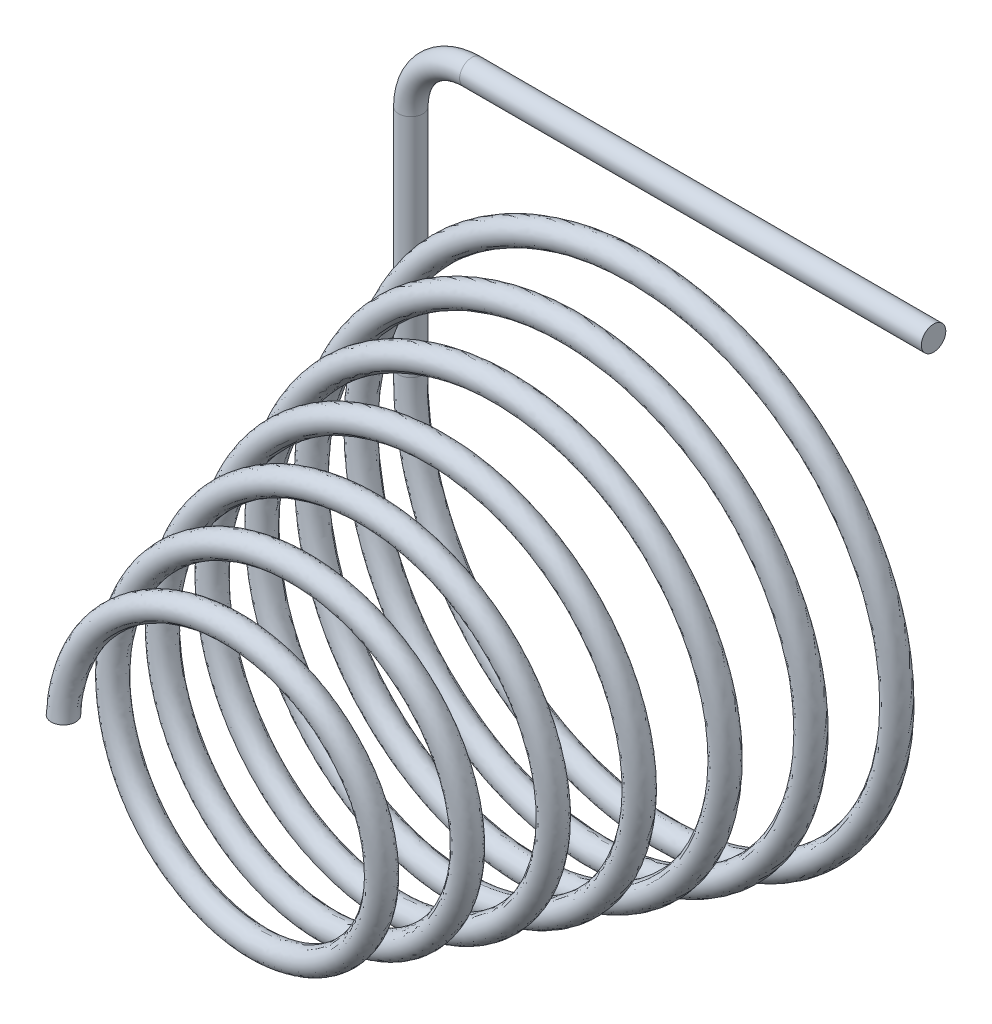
ISO-10303-21;
HEADER;
FILE_DESCRIPTION(('STEP AP214'),'2;1');
FILE_NAME('part.step','',(''),(''),'','','');
FILE_SCHEMA(('AUTOMOTIVE_DESIGN { 1 0 10303 214 1 1 1 1 }'));
ENDSEC;
DATA;
#1=APPLICATION_CONTEXT('core data for automotive mechanical design processes');
#2=APPLICATION_PROTOCOL_DEFINITION('international standard','automotive_design',2000,#1);
#3=PRODUCT_CONTEXT('',#1,'mechanical');
#4=PRODUCT('Part','Part','',(#3));
#5=PRODUCT_RELATED_PRODUCT_CATEGORY('part','',(#4));
#6=PRODUCT_DEFINITION_FORMATION('','',#4);
#7=PRODUCT_DEFINITION_CONTEXT('part definition',#1,'design');
#8=PRODUCT_DEFINITION('design','',#6,#7);
#9=PRODUCT_DEFINITION_SHAPE('','',#8);
#10=(LENGTH_UNIT() NAMED_UNIT(*) SI_UNIT(.MILLI.,.METRE.));
#11=(NAMED_UNIT(*) PLANE_ANGLE_UNIT() SI_UNIT($,.RADIAN.));
#12=(NAMED_UNIT(*) SI_UNIT($,.STERADIAN.) SOLID_ANGLE_UNIT());
#13=UNCERTAINTY_MEASURE_WITH_UNIT(LENGTH_MEASURE(1.E-05),#10,'distance_accuracy_value','');
#14=(GEOMETRIC_REPRESENTATION_CONTEXT(3) GLOBAL_UNCERTAINTY_ASSIGNED_CONTEXT((#13)) GLOBAL_UNIT_ASSIGNED_CONTEXT((#10,
#11,#12)) REPRESENTATION_CONTEXT('',''));
#15=CARTESIAN_POINT('',(0.,0.,0.));
#16=DIRECTION('',(0.,0.,1.));
#17=DIRECTION('',(1.,0.,0.));
#18=AXIS2_PLACEMENT_3D('',#15,#16,#17);
#19=CARTESIAN_POINT('',(-3.37392608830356,-2.78857550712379E-13,11.6666666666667));
#20=DIRECTION('',(0.,1.,0.));
#21=DIRECTION('',(0.,0.,1.));
#22=AXIS2_PLACEMENT_3D('',#19,#20,#21);
#23=PLANE('',#22);
#24=CARTESIAN_POINT('',(-3.37392608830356,-2.78857550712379E-13,11.6666666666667));
#25=DIRECTION('',(0.,1.,0.));
#26=DIRECTION('',(0.,0.,1.));
#27=AXIS2_PLACEMENT_3D('',#24,#25,#26);
#28=CIRCLE('',#27,0.3);
#29=CARTESIAN_POINT('',(-3.37392608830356,-2.78857550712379E-13,11.9666666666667));
#30=VERTEX_POINT('',#29);
#31=EDGE_CURVE('E11',#30,#30,#28,.T.);
#32=ORIENTED_EDGE('',*,*,#31,.F.);
#33=EDGE_LOOP('',(#32));
#34=FACE_BOUND('',#33,.T.);
#35=ADVANCED_FACE('F31',(#34),#23,.F.);
#36=CARTESIAN_POINT('',(-6.5,0.,0.3));
#37=CARTESIAN_POINT('',(-6.48371811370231,-1.48899107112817,0.360763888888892));
#38=CARTESIAN_POINT('',(-5.93689704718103,-2.96055015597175,0.421527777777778));
#39=CARTESIAN_POINT('',(-4.0367236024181,-5.22458877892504,0.543055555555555));
#40=CARTESIAN_POINT('',(-2.69062707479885,-6.00914035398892,0.603819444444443));
#41=CARTESIAN_POINT('',(0.19256956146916,-6.5494428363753,0.725347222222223));
#42=CARTESIAN_POINT('',(1.71911800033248,-6.30369219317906,0.78611111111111));
#43=CARTESIAN_POINT('',(4.27088760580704,-4.90282008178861,0.90763888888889));
#44=CARTESIAN_POINT('',(5.28707125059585,-3.75319353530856,0.968402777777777));
#45=CARTESIAN_POINT('',(6.36234820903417,-1.07215399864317,1.08993055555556));
#46=CARTESIAN_POINT('',(6.41797243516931,0.449353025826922,1.15069444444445));
#47=CARTESIAN_POINT('',(5.55483533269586,3.1825585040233,1.27222222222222));
#48=CARTESIAN_POINT('',(4.6396530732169,4.38447647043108,1.33298611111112));
#49=CARTESIAN_POINT('',(2.25711865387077,5.93727184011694,1.45451388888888));
#50=CARTESIAN_POINT('',(0.798670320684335,6.28290446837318,1.51527777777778));
#51=CARTESIAN_POINT('',(-2.00586621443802,5.97396113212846,1.63680555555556));
#52=CARTESIAN_POINT('',(-3.34182521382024,5.32097147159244,1.69756944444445));
#53=CARTESIAN_POINT('',(-5.29794592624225,3.31879966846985,1.81909722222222));
#54=CARTESIAN_POINT('',(-5.91134141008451,1.9772122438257,1.87986111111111));
#55=CARTESIAN_POINT('',(-6.15108537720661,-0.7891669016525,2.00138888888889));
#56=CARTESIAN_POINT('',(-5.77702949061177,-2.20387617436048,2.06215277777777));
#57=CARTESIAN_POINT('',(-4.21981438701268,-4.47580135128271,2.18368055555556));
#58=CARTESIAN_POINT('',(-3.04269371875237,-5.32503439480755,2.24444444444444));
#59=CARTESIAN_POINT('',(-0.419070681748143,-6.08687345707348,2.36597222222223));
#60=CARTESIAN_POINT('',(1.01777724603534,-5.9971630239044,2.42673611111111));
#61=CARTESIAN_POINT('',(3.5084961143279,-4.93022750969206,2.54826388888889));
#62=CARTESIAN_POINT('',(4.55350953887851,-3.95730542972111,2.60902777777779));
#63=CARTESIAN_POINT('',(5.79145553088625,-1.57219360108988,2.73055555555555));
#64=CARTESIAN_POINT('',(5.98030921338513,-0.168877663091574,2.79131944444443));
#65=CARTESIAN_POINT('',(5.42852124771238,2.43823513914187,2.91284722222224));
#66=CARTESIAN_POINT('',(4.69034022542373,3.63266446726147,2.97361111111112));
#67=CARTESIAN_POINT('',(2.62716608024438,5.28374276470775,3.09513888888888));
#68=CARTESIAN_POINT('',(1.30995498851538,5.73476304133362,3.15590277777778));
#69=CARTESIAN_POINT('',(-1.30995498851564,5.70220000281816,3.27743055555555));
#70=CARTESIAN_POINT('',(-2.60314866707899,5.21920251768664,3.33819444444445));
#71=CARTESIAN_POINT('',(-4.5904101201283,3.54617422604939,3.45972222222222));
#72=CARTESIAN_POINT('',(-5.27756467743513,2.36257480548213,3.52048611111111));
#73=CARTESIAN_POINT('',(-5.74801487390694,-0.169450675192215,3.64201388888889));
#74=CARTESIAN_POINT('',(-5.5300623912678,-1.50859913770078,3.70277777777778));
#75=CARTESIAN_POINT('',(-4.29797435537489,-3.74459594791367,3.82430555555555));
#76=CARTESIAN_POINT('',(-3.28872136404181,-4.63355241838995,3.88506944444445));
#77=CARTESIAN_POINT('',(-0.938477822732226,-5.57180918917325,4.00659722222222));
#78=CARTESIAN_POINT('',(0.393806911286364,-5.61813752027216,4.06736111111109));
#79=CARTESIAN_POINT('',(2.78437894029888,-4.85893713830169,4.18888888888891));
#80=CARTESIAN_POINT('',(3.83412884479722,-4.05661040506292,4.24965277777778));
#81=CARTESIAN_POINT('',(5.18800173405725,-1.97178451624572,4.37118055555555));
#82=CARTESIAN_POINT('',(5.48760164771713,-0.69710908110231,4.43194444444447));
#83=CARTESIAN_POINT('',(5.21375344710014,1.75110056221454,4.55347222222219));
#84=CARTESIAN_POINT('',(4.64176430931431,2.91579834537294,4.61423611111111));
#85=CARTESIAN_POINT('',(2.89277280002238,4.61873876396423,4.73576388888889));
#86=CARTESIAN_POINT('',(1.72244659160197,5.15113372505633,4.79652777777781));
#87=CARTESIAN_POINT('',(-0.687605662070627,5.35578255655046,4.91805555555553));
#88=CARTESIAN_POINT('',(-1.9185420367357,5.02775938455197,4.97881944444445));
#89=CARTESIAN_POINT('',(-3.8927586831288,3.66946676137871,5.10034722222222));
#90=CARTESIAN_POINT('',(-4.6291362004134,2.64451415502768,5.16111111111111));
#91=CARTESIAN_POINT('',(-5.28703854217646,0.363524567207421,5.28263888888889));
#92=CARTESIAN_POINT('',(-5.20662400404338,-0.884101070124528,5.34340277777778));
#93=CARTESIAN_POINT('',(-4.27670867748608,-3.04402394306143,5.46493055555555));
#94=CARTESIAN_POINT('',(-3.43101377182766,-3.94866381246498,5.52569444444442));
#95=CARTESIAN_POINT('',(-1.36167473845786,-5.01782572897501,5.64722222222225));
#96=CARTESIAN_POINT('',(-0.145758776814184,-5.17888125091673,5.70798611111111));
#97=CARTESIAN_POINT('',(2.11018286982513,-4.69694557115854,5.82951388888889));
#98=CARTESIAN_POINT('',(3.14211509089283,-4.05616156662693,5.89027777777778));
#99=CARTESIAN_POINT('',(4.56604823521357,-2.26976459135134,6.01180555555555));
#100=CARTESIAN_POINT('',(4.95324456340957,-1.13092948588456,6.07256944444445));
#101=CARTESIAN_POINT('',(4.92068152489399,1.13092948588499,6.19409722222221));
#102=CARTESIAN_POINT('',(4.50150798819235,2.24574717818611,6.25486111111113));
#103=CARTESIAN_POINT('',(3.05562484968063,3.95623146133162,6.37638888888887));
#104=CARTESIAN_POINT('',(2.03452253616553,4.54598900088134,6.43715277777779));
#105=CARTESIAN_POINT('',(-0.146331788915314,4.94658691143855,6.55868055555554));
#106=CARTESIAN_POINT('',(-1.29808027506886,4.75643258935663,6.61944444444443));
#107=CARTESIAN_POINT('',(-3.21830429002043,3.69312862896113,6.74097222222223));
#108=CARTESIAN_POINT('',(-3.98003358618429,2.82424919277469,6.8017361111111));
#109=CARTESIAN_POINT('',(-4.78127016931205,0.804801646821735,6.9232638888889));
#110=CARTESIAN_POINT('',(-4.81830260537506,-0.338260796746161,6.98402777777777));
#111=CARTESIAN_POINT('',(-4.16303894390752,-2.38619937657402,7.10555555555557));
#112=CARTESIAN_POINT('',(-3.4735677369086,-3.2837812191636,7.16631944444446));
#113=CARTESIAN_POINT('',(-1.68645037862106,-4.43873162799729,7.28784722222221));
#114=CARTESIAN_POINT('',(-0.595547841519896,-4.69229882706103,7.34861111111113));
#115=CARTESIAN_POINT('',(1.49633490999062,-4.45354576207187,7.47013888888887));
#116=CARTESIAN_POINT('',(2.48977147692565,-3.96255714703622,7.53090277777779));
#117=CARTESIAN_POINT('',(3.93953160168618,-2.46674593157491,7.65243055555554));
#118=CARTESIAN_POINT('',(4.39092604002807,-1.46768093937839,7.71319444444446));
#119=CARTESIAN_POINT('',(4.56047973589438,0.586044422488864,7.83472222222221));
#120=CARTESIAN_POINT('',(4.27848927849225,1.63320789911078,7.89548611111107));
#121=CARTESIAN_POINT('',(3.11911913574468,3.309716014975,8.01701388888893));
#122=CARTESIAN_POINT('',(2.24633459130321,3.93323800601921,8.07777777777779));
#123=CARTESIAN_POINT('',(0.307978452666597,4.48720362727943,8.19930555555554));
#124=CARTESIAN_POINT('',(-0.750424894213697,4.41608498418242,8.26006944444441));
#125=CARTESIAN_POINT('',(-2.57955177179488,3.62318984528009,8.38159722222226));
#126=CARTESIAN_POINT('',(-3.34381808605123,2.9047221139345,8.44236111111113));
#127=CARTESIAN_POINT('',(-4.24419592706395,1.15115587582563,8.56388888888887));
#128=CARTESIAN_POINT('',(-4.3774532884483,0.122639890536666,8.62465277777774));
#129=CARTESIAN_POINT('',(-3.96536989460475,-1.78213060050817,8.74618055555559));
#130=CARTESIAN_POINT('',(-3.42198290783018,-2.65156571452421,8.80694444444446));
#131=CARTESIAN_POINT('',(-1.91236310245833,-3.8483537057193,8.92847222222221));
#132=CARTESIAN_POINT('',(-0.951903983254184,-4.17172608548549,8.98923611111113));
#133=CARTESIAN_POINT('',(0.951903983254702,-4.13916304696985,9.11076388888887));
#134=CARTESIAN_POINT('',(1.88834568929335,-3.78381345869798,9.17152777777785));
#135=CARTESIAN_POINT('',(3.32205280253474,-2.56507547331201,9.29305555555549));
#136=CARTESIAN_POINT('',(3.81441332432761,-1.70647026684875,9.35381944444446));
#137=CARTESIAN_POINT('',(4.14515894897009,0.123212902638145,9.47534722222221));
#138=CARTESIAN_POINT('',(3.98280278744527,1.08756141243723,9.53611111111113));
#139=CARTESIAN_POINT('',(3.08828290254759,2.69201263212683,9.65763888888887));
#140=CARTESIAN_POINT('',(2.35977702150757,3.32651475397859,9.71840277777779));
#141=CARTESIAN_POINT('',(0.671125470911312,3.99073114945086,9.83993055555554));
#142=CARTESIAN_POINT('',(-0.282714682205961,4.01846769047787,9.90069444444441));
#143=CARTESIAN_POINT('',(-1.98801981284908,3.46714074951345,10.0222222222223));
#144=CARTESIAN_POINT('',(-2.73343359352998,2.89052506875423,10.0829861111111));
#145=CARTESIAN_POINT('',(-3.68946152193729,1.40111624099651,10.2045138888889));
#146=CARTESIAN_POINT('',(-3.89699600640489,0.493986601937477,10.2652777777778));
#147=CARTESIAN_POINT('',(-3.69333807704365,-1.24156925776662,10.3868055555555));
#148=CARTESIAN_POINT('',(-3.28334998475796,-2.06374460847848,10.4475694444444));
#149=CARTESIAN_POINT('',(-2.04071906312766,-3.26032443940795,10.5690972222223));
#150=CARTESIAN_POINT('',(-1.21291528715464,-3.63071835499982,10.6298611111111));
#151=CARTESIAN_POINT('',(0.484483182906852,-3.76517691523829,10.7513888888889));
#152=CARTESIAN_POINT('',(1.34787376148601,-3.52921917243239,10.8121527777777));
#153=CARTESIAN_POINT('',(2.72667334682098,-2.56877151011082,10.9336805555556));
#154=CARTESIAN_POINT('',(3.23733981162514,-1.84815502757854,10.9944444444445));
#155=CARTESIAN_POINT('',(3.68736871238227,-0.252432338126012,11.1159722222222));
#156=CARTESIAN_POINT('',(3.62554596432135,0.616748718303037,11.1767361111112));
#157=CARTESIAN_POINT('',(2.96967101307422,2.11507960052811,11.2982638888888));
#158=CARTESIAN_POINT('',(2.37843045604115,2.73897235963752,11.3590277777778));
#159=CARTESIAN_POINT('',(0.940637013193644,3.47056612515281,11.4805555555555));
#160=CARTESIAN_POINT('',(0.0995210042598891,3.57602532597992,11.5413194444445));
#161=CARTESIAN_POINT('',(-1.4540783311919,3.23379421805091,11.6628472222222));
#162=CARTESIAN_POINT('',(-2.16101633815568,2.78780424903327,11.7236111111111));
#163=CARTESIAN_POINT('',(-3.13065917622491,1.5549616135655,11.8451388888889));
#164=CARTESIAN_POINT('',(-3.3902079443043,0.772883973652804,11.9059027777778));
#165=CARTESIAN_POINT('',(-3.37392608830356,-2.78857550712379E-13,11.9666666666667));
#166=CARTESIAN_POINT('',(-5.9,0.,0.3));
#167=CARTESIAN_POINT('',(-5.88371811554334,-1.35154574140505,0.360763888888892));
#168=CARTESIAN_POINT('',(-5.38589700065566,-2.68616010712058,0.421527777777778));
#169=CARTESIAN_POINT('',(-3.66011110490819,-4.73770688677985,0.543055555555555));
#170=CARTESIAN_POINT('',(-2.43876948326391,-5.44748324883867,0.603819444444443));
#171=CARTESIAN_POINT('',(0.174820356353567,-5.93415760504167,0.725347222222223));
#172=CARTESIAN_POINT('',(1.55749505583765,-5.70974861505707,0.78611111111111));
#173=CARTESIAN_POINT('',(3.86683446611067,-4.43845814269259,0.90763888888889));
#174=CARTESIAN_POINT('',(4.78534120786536,-3.39660145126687,0.968402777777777));
#175=CARTESIAN_POINT('',(5.75542281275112,-0.969525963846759,1.08993055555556));
#176=CARTESIAN_POINT('',(5.80391024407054,0.406708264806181,1.15069444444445));
#177=CARTESIAN_POINT('',(5.02056912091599,2.87686165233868,1.27222222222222));
#178=CARTESIAN_POINT('',(4.19203013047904,3.96195469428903,1.33298611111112));
#179=CARTESIAN_POINT('',(2.03805731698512,5.36203008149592,1.45451388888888));
#180=CARTESIAN_POINT('',(0.720698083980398,5.6723217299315,1.51527777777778));
#181=CARTESIAN_POINT('',(-1.8102734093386,5.39032219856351,1.63680555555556));
#182=CARTESIAN_POINT('',(-3.01474897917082,4.79951956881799,1.69756944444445));
#183=CARTESIAN_POINT('',(-4.77649402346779,2.99172343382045,1.81909722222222));
#184=CARTESIAN_POINT('',(-5.32770247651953,1.78161943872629,1.87986111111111));
#185=CARTESIAN_POINT('',(-5.54050263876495,-0.711194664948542,2.00138888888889));
#186=CARTESIAN_POINT('',(-5.20178773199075,-1.98481483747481,2.06215277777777));
#187=CARTESIAN_POINT('',(-3.79729261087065,-4.02817840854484,2.18368055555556));
#188=CARTESIAN_POINT('',(-2.73699686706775,-4.79076818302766,2.24444444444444));
#189=CARTESIAN_POINT('',(-0.37642592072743,-5.47281126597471,2.36597222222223));
#190=CARTESIAN_POINT('',(0.915149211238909,-5.39023762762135,2.42673611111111));
#191=CARTESIAN_POINT('',(3.1519040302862,-4.42849746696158,2.54826388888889));
#192=CARTESIAN_POINT('',(4.08914759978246,-3.55325229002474,2.60902777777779));
#193=CARTESIAN_POINT('',(5.19751195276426,-1.41057065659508,2.73055555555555));
#194=CARTESIAN_POINT('',(5.36502398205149,-0.151128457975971,2.79131944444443));
#195=CARTESIAN_POINT('',(4.86686414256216,2.18637754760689,2.91284722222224));
#196=CARTESIAN_POINT('',(4.20345833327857,3.25605196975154,2.97361111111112));
#197=CARTESIAN_POINT('',(2.35277603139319,4.73274271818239,3.09513888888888));
#198=CARTESIAN_POINT('',(1.17251063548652,5.13476304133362,3.15590277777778));
#199=CARTESIAN_POINT('',(-1.17251063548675,5.10220000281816,3.27743055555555));
#200=CARTESIAN_POINT('',(-2.32875861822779,4.66820247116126,3.33819444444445));
#201=CARTESIAN_POINT('',(-4.1035282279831,3.1695617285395,3.45972222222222));
#202=CARTESIAN_POINT('',(-4.71590757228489,2.1107172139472,3.52048611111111));
#203=CARTESIAN_POINT('',(-5.13272964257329,-0.151701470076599,3.64201388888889));
#204=CARTESIAN_POINT('',(-4.93611881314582,-1.3469761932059,3.70277777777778));
#205=CARTESIAN_POINT('',(-3.83361241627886,-3.34054280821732,3.82430555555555));
#206=CARTESIAN_POINT('',(-2.93212928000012,-4.13182237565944,3.88506944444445));
#207=CARTESIAN_POINT('',(-0.835849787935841,-4.9648837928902,4.00659722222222));
#208=CARTESIAN_POINT('',(0.35116215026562,-5.00407532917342,4.06736111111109));
#209=CARTESIAN_POINT('',(2.47868208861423,-4.3246709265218,4.18888888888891));
#210=CARTESIAN_POINT('',(3.41160706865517,-3.60898746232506,4.24965277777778));
#211=CARTESIAN_POINT('',(4.61275997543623,-1.7527231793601,4.37118055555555));
#212=CARTESIAN_POINT('',(4.87701890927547,-0.619136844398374,4.43194444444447));
#213=CARTESIAN_POINT('',(4.63011451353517,1.55550775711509,4.55347222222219));
#214=CARTESIAN_POINT('',(4.12031240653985,2.58872211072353,4.61423611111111));
#215=CARTESIAN_POINT('',(2.56569656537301,4.09728686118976,4.73576388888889));
#216=CARTESIAN_POINT('',(1.52685378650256,4.56749479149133,4.79652777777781));
#217=CARTESIAN_POINT('',(-0.609633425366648,4.74519981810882,4.91805555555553));
#218=CARTESIAN_POINT('',(-1.69948069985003,4.45251762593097,4.97881944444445));
#219=CARTESIAN_POINT('',(-3.44513574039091,3.24694498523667,5.10034722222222));
#220=CARTESIAN_POINT('',(-4.0948699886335,2.33881730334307,5.16111111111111));
#221=CARTESIAN_POINT('',(-4.67297635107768,0.320879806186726,5.28263888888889));
#222=CARTESIAN_POINT('',(-4.59969860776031,-0.781473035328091,5.34340277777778));
#223=CARTESIAN_POINT('',(-3.77497863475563,-2.68743185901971,5.46493055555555));
#224=CARTESIAN_POINT('',(-3.0269606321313,-3.48430187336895,5.52569444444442));
#225=CARTESIAN_POINT('',(-1.20005179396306,-4.42388215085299,5.64722222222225));
#226=CARTESIAN_POINT('',(-0.128009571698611,-4.5635960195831,5.70798611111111));
#227=CARTESIAN_POINT('',(1.85832527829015,-4.13528846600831,5.82951388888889));
#228=CARTESIAN_POINT('',(2.76550259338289,-3.56927967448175,5.89027777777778));
#229=CARTESIAN_POINT('',(4.01504818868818,-1.99537454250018,6.01180555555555));
#230=CARTESIAN_POINT('',(4.35324456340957,-0.993485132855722,6.07256944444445));
#231=CARTESIAN_POINT('',(4.32068152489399,0.993485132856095,6.19409722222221));
#232=CARTESIAN_POINT('',(3.95050794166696,1.97135712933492,6.25486111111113));
#233=CARTESIAN_POINT('',(2.67901235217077,3.46934956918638,6.37638888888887));
#234=CARTESIAN_POINT('',(1.78266494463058,3.98433189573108,6.43715277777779));
#235=CARTESIAN_POINT('',(-0.128582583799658,4.33130168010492,6.55868055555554));
#236=CARTESIAN_POINT('',(-1.13645733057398,4.16248901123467,6.61944444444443));
#237=CARTESIAN_POINT('',(-2.81425115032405,3.22876668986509,6.74097222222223));
#238=CARTESIAN_POINT('',(-3.47830354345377,2.46765710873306,6.8017361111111));
#239=CARTESIAN_POINT('',(-4.17434477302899,0.702173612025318,6.9232638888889));
#240=CARTESIAN_POINT('',(-4.2042404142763,-0.295616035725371,6.98402777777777));
#241=CARTESIAN_POINT('',(-3.62877273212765,-2.08050252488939,7.10555555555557));
#242=CARTESIAN_POINT('',(-3.02594479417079,-2.86125944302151,7.16631944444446));
#243=CARTESIAN_POINT('',(-1.46738904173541,-3.86348986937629,7.28784722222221));
#244=CARTESIAN_POINT('',(-0.51757560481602,-4.08171608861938,7.34861111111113));
#245=CARTESIAN_POINT('',(1.3007421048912,-3.86990682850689,7.47013888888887));
#246=CARTESIAN_POINT('',(2.16269524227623,-3.44110524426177,7.53090277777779));
#247=CARTESIAN_POINT('',(3.41807969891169,-2.13966969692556,7.65243055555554));
#248=CARTESIAN_POINT('',(3.80728710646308,-1.27208813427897,7.71319444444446));
#249=CARTESIAN_POINT('',(3.94989699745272,0.508072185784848,7.83472222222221));
#250=CARTESIAN_POINT('',(3.70324751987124,1.41414656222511,7.89548611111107));
#251=CARTESIAN_POINT('',(2.69659735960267,2.86209307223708,8.01701388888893));
#252=CARTESIAN_POINT('',(1.94063773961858,3.39897179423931,8.07777777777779));
#253=CARTESIAN_POINT('',(0.265333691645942,3.87314143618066,8.19930555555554));
#254=CARTESIAN_POINT('',(-0.647796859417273,3.80915958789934,8.26006944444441));
#255=CARTESIAN_POINT('',(-2.22295968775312,3.12145980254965,8.38159722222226));
#256=CARTESIAN_POINT('',(-2.87945614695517,2.50066897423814,8.44236111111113));
#257=CARTESIAN_POINT('',(-3.65025234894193,0.989532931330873,8.56388888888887));
#258=CARTESIAN_POINT('',(-3.76216805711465,0.104890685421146,8.62465277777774));
#259=CARTESIAN_POINT('',(-3.40371278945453,-1.53027300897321,8.74618055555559));
#260=CARTESIAN_POINT('',(-2.93510101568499,-2.2749532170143,8.80694444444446));
#261=CARTESIAN_POINT('',(-1.6379730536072,-3.29735365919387,8.92847222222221));
#262=CARTESIAN_POINT('',(-0.814459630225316,-3.57172608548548,8.98923611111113));
#263=CARTESIAN_POINT('',(0.814459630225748,-3.53916304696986,9.11076388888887));
#264=CARTESIAN_POINT('',(1.61395564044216,-3.23281341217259,9.17152777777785));
#265=CARTESIAN_POINT('',(2.83517091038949,-2.18846297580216,9.29305555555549));
#266=CARTESIAN_POINT('',(3.25275621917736,-1.45461267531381,9.35381944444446));
#267=CARTESIAN_POINT('',(3.52987371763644,0.105463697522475,9.47534722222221));
#268=CARTESIAN_POINT('',(3.38885920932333,0.925938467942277,9.53611111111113));
#269=CARTESIAN_POINT('',(2.62392096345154,2.28795949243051,9.65763888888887));
#270=CARTESIAN_POINT('',(2.00318493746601,2.82478471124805,9.71840277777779));
#271=CARTESIAN_POINT('',(0.568497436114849,3.38380575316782,9.83993055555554));
#272=CARTESIAN_POINT('',(-0.240069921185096,3.40440549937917,9.90069444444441));
#273=CARTESIAN_POINT('',(-1.6823229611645,2.93287453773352,10.0222222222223));
#274=CARTESIAN_POINT('',(-2.31091181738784,2.44290212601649,10.0829861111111));
#275=CARTESIAN_POINT('',(-3.11421976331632,1.18205490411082,10.2045138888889));
#276=CARTESIAN_POINT('',(-3.28641326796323,0.416014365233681,10.2652777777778));
#277=CARTESIAN_POINT('',(-3.10969914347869,-1.04597645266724,10.3868055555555));
#278=CARTESIAN_POINT('',(-2.76189808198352,-1.73666837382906,10.4475694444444));
#279=CARTESIAN_POINT('',(-1.71364282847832,-2.73887253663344,10.5690972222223));
#280=CARTESIAN_POINT('',(-1.01732248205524,-3.04707942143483,10.6298611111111));
#281=CARTESIAN_POINT('',(0.40651094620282,-3.15459417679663,10.7513888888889));
#282=CARTESIAN_POINT('',(1.12881242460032,-2.95397741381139,10.8121527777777));
#283=CARTESIAN_POINT('',(2.27905040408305,-2.14624973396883,10.9336805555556));
#284=CARTESIAN_POINT('',(2.70307359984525,-1.54245817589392,10.9944444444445));
#285=CARTESIAN_POINT('',(3.07330652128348,-0.209787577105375,11.1159722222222));
#286=CARTESIAN_POINT('',(3.01862056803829,0.514120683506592,11.1767361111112));
#287=CARTESIAN_POINT('',(2.46794097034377,1.75848751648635,11.2982638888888));
#288=CARTESIAN_POINT('',(1.97437731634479,2.27461042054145,11.3590277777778));
#289=CARTESIAN_POINT('',(0.779014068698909,2.8766225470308,11.4805555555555));
#290=CARTESIAN_POINT('',(0.0817717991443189,2.96074009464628,11.5413194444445));
#291=CARTESIAN_POINT('',(-1.20222073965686,2.6721371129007,11.6628472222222));
#292=CARTESIAN_POINT('',(-1.78440384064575,2.30092235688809,11.7236111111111));
#293=CARTESIAN_POINT('',(-2.57965912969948,1.28057156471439,11.8451388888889));
#294=CARTESIAN_POINT('',(-2.79020794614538,0.635438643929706,11.9059027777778));
#295=CARTESIAN_POINT('',(-2.77392608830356,-2.20200630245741E-13,11.9666666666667));
#296=CARTESIAN_POINT('',(-5.9,0.,-0.3));
#297=CARTESIAN_POINT('',(-5.8837181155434,-1.35154574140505,-0.239236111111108));
#298=CARTESIAN_POINT('',(-5.38589700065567,-2.68616010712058,-0.178472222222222));
#299=CARTESIAN_POINT('',(-3.66011110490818,-4.73770688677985,-0.0569444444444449));
#300=CARTESIAN_POINT('',(-2.43876948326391,-5.44748324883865,0.00381944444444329));
#301=CARTESIAN_POINT('',(0.174820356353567,-5.9341576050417,0.125347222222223));
#302=CARTESIAN_POINT('',(1.55749505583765,-5.70974861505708,0.18611111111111));
#303=CARTESIAN_POINT('',(3.86683446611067,-4.43845814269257,0.30763888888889));
#304=CARTESIAN_POINT('',(4.78534120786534,-3.39660145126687,0.368402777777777));
#305=CARTESIAN_POINT('',(5.75542281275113,-0.969525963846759,0.489930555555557));
#306=CARTESIAN_POINT('',(5.80391024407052,0.406708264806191,0.550694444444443));
#307=CARTESIAN_POINT('',(5.020569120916,2.87686165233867,0.672222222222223));
#308=CARTESIAN_POINT('',(4.19203013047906,3.96195469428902,0.732986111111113));
#309=CARTESIAN_POINT('',(2.03805731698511,5.36203008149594,0.854513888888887));
#310=CARTESIAN_POINT('',(0.720698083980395,5.6723217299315,0.915277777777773));
#311=CARTESIAN_POINT('',(-1.81027340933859,5.39032219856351,1.03680555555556));
#312=CARTESIAN_POINT('',(-3.01474897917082,4.79951956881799,1.09756944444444));
#313=CARTESIAN_POINT('',(-4.7764940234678,2.99172343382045,1.21909722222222));
#314=CARTESIAN_POINT('',(-5.32770247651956,1.78161943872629,1.27986111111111));
#315=CARTESIAN_POINT('',(-5.54050263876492,-0.711194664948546,1.40138888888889));
#316=CARTESIAN_POINT('',(-5.20178773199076,-1.98481483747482,1.46215277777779));
#317=CARTESIAN_POINT('',(-3.79729261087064,-4.02817840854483,1.58368055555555));
#318=CARTESIAN_POINT('',(-2.73699686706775,-4.79076818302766,1.64444444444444));
#319=CARTESIAN_POINT('',(-0.376425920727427,-5.47281126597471,1.76597222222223));
#320=CARTESIAN_POINT('',(0.915149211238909,-5.39023762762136,1.82673611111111));
#321=CARTESIAN_POINT('',(3.1519040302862,-4.42849746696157,1.94826388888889));
#322=CARTESIAN_POINT('',(4.08914759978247,-3.55325229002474,2.00902777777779));
#323=CARTESIAN_POINT('',(5.19751195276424,-1.41057065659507,2.13055555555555));
#324=CARTESIAN_POINT('',(5.3650239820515,-0.151128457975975,2.19131944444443));
#325=CARTESIAN_POINT('',(4.86686414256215,2.1863775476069,2.31284722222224));
#326=CARTESIAN_POINT('',(4.20345833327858,3.25605196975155,2.37361111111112));
#327=CARTESIAN_POINT('',(2.35277603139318,4.73274271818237,2.49513888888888));
#328=CARTESIAN_POINT('',(1.17251063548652,5.13476304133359,2.55590277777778));
#329=CARTESIAN_POINT('',(-1.17251063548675,5.10220000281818,2.67743055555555));
#330=CARTESIAN_POINT('',(-2.32875861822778,4.66820247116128,2.73819444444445));
#331=CARTESIAN_POINT('',(-4.10352822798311,3.16956172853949,2.85972222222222));
#332=CARTESIAN_POINT('',(-4.71590757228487,2.11071721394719,2.92048611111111));
#333=CARTESIAN_POINT('',(-5.13272964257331,-0.151701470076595,3.04201388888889));
#334=CARTESIAN_POINT('',(-4.93611881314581,-1.3469761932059,3.10277777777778));
#335=CARTESIAN_POINT('',(-3.83361241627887,-3.34054280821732,3.22430555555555));
#336=CARTESIAN_POINT('',(-2.93212928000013,-4.13182237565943,3.28506944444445));
#337=CARTESIAN_POINT('',(-0.835849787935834,-4.96488379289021,3.40659722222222));
#338=CARTESIAN_POINT('',(0.351162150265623,-5.00407532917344,3.4673611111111));
#339=CARTESIAN_POINT('',(2.47868208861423,-4.32467092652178,3.5888888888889));
#340=CARTESIAN_POINT('',(3.41160706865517,-3.60898746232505,3.64965277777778));
#341=CARTESIAN_POINT('',(4.61275997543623,-1.7527231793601,3.77118055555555));
#342=CARTESIAN_POINT('',(4.87701890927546,-0.619136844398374,3.83194444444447));
#343=CARTESIAN_POINT('',(4.63011451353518,1.55550775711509,3.95347222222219));
#344=CARTESIAN_POINT('',(4.12031240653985,2.58872211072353,4.01423611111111));
#345=CARTESIAN_POINT('',(2.56569656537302,4.09728686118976,4.13576388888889));
#346=CARTESIAN_POINT('',(1.52685378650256,4.56749479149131,4.19652777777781));
#347=CARTESIAN_POINT('',(-0.609633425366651,4.74519981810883,4.31805555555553));
#348=CARTESIAN_POINT('',(-1.69948069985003,4.452517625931,4.37881944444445));
#349=CARTESIAN_POINT('',(-3.44513574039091,3.24694498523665,4.50034722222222));
#350=CARTESIAN_POINT('',(-4.09486998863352,2.33881730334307,4.56111111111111));
#351=CARTESIAN_POINT('',(-4.67297635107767,0.32087980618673,4.68263888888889));
#352=CARTESIAN_POINT('',(-4.59969860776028,-0.781473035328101,4.74340277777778));
#353=CARTESIAN_POINT('',(-3.77497863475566,-2.6874318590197,4.86493055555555));
#354=CARTESIAN_POINT('',(-3.0269606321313,-3.48430187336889,4.92569444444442));
#355=CARTESIAN_POINT('',(-1.20005179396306,-4.42388215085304,5.04722222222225));
#356=CARTESIAN_POINT('',(-0.12800957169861,-4.56359601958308,5.10798611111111));
#357=CARTESIAN_POINT('',(1.85832527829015,-4.13528846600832,5.22951388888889));
#358=CARTESIAN_POINT('',(2.76550259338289,-3.56927967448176,5.29027777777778));
#359=CARTESIAN_POINT('',(4.01504818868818,-1.99537454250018,5.41180555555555));
#360=CARTESIAN_POINT('',(4.35324456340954,-0.993485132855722,5.47256944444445));
#361=CARTESIAN_POINT('',(4.32068152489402,0.993485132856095,5.59409722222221));
#362=CARTESIAN_POINT('',(3.95050794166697,1.97135712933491,5.65486111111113));
#363=CARTESIAN_POINT('',(2.67901235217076,3.46934956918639,5.77638888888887));
#364=CARTESIAN_POINT('',(1.78266494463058,3.9843318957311,5.83715277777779));
#365=CARTESIAN_POINT('',(-0.128582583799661,4.3313016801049,5.95868055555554));
#366=CARTESIAN_POINT('',(-1.13645733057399,4.16248901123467,6.01944444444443));
#367=CARTESIAN_POINT('',(-2.81425115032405,3.2287666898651,6.14097222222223));
#368=CARTESIAN_POINT('',(-3.47830354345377,2.46765710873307,6.2017361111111));
#369=CARTESIAN_POINT('',(-4.17434477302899,0.702173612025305,6.3232638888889));
#370=CARTESIAN_POINT('',(-4.20424041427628,-0.295616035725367,6.38402777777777));
#371=CARTESIAN_POINT('',(-3.62877273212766,-2.08050252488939,6.50555555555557));
#372=CARTESIAN_POINT('',(-3.02594479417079,-2.86125944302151,6.56631944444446));
#373=CARTESIAN_POINT('',(-1.46738904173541,-3.86348986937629,6.68784722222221));
#374=CARTESIAN_POINT('',(-0.517575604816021,-4.08171608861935,6.74861111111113));
#375=CARTESIAN_POINT('',(1.3007421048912,-3.86990682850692,6.87013888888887));
#376=CARTESIAN_POINT('',(2.16269524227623,-3.44110524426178,6.93090277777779));
#377=CARTESIAN_POINT('',(3.41807969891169,-2.13966969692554,7.05243055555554));
#378=CARTESIAN_POINT('',(3.80728710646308,-1.27208813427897,7.11319444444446));
#379=CARTESIAN_POINT('',(3.94989699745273,0.508072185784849,7.23472222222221));
#380=CARTESIAN_POINT('',(3.70324751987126,1.41414656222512,7.2954861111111));
#381=CARTESIAN_POINT('',(2.69659735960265,2.86209307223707,7.4170138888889));
#382=CARTESIAN_POINT('',(1.94063773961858,3.39897179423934,7.47777777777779));
#383=CARTESIAN_POINT('',(0.265333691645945,3.87314143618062,7.59930555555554));
#384=CARTESIAN_POINT('',(-0.64779685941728,3.80915958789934,7.66006944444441));
#385=CARTESIAN_POINT('',(-2.22295968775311,3.12145980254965,7.78159722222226));
#386=CARTESIAN_POINT('',(-2.87945614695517,2.50066897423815,7.84236111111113));
#387=CARTESIAN_POINT('',(-3.65025234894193,0.98953293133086,7.96388888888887));
#388=CARTESIAN_POINT('',(-3.76216805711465,0.104890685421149,8.02465277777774));
#389=CARTESIAN_POINT('',(-3.40371278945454,-1.53027300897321,8.14618055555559));
#390=CARTESIAN_POINT('',(-2.935101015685,-2.2749532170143,8.20694444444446));
#391=CARTESIAN_POINT('',(-1.63797305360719,-3.29735365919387,8.32847222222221));
#392=CARTESIAN_POINT('',(-0.814459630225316,-3.57172608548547,8.38923611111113));
#393=CARTESIAN_POINT('',(0.814459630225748,-3.53916304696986,8.51076388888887));
#394=CARTESIAN_POINT('',(1.61395564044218,-3.23281341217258,8.57152777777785));
#395=CARTESIAN_POINT('',(2.83517091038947,-2.18846297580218,8.69305555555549));
#396=CARTESIAN_POINT('',(3.25275621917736,-1.45461267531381,8.75381944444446));
#397=CARTESIAN_POINT('',(3.52987371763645,0.105463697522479,8.87534722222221));
#398=CARTESIAN_POINT('',(3.38885920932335,0.925938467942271,8.93611111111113));
#399=CARTESIAN_POINT('',(2.62392096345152,2.28795949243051,9.05763888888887));
#400=CARTESIAN_POINT('',(2.003184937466,2.82478471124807,9.11840277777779));
#401=CARTESIAN_POINT('',(0.568497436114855,3.3838057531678,9.23993055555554));
#402=CARTESIAN_POINT('',(-0.240069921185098,3.40440549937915,9.30069444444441));
#403=CARTESIAN_POINT('',(-1.6823229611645,2.93287453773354,9.42222222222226));
#404=CARTESIAN_POINT('',(-2.31091181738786,2.44290212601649,9.48298611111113));
#405=CARTESIAN_POINT('',(-3.11421976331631,1.18205490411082,9.60451388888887));
#406=CARTESIAN_POINT('',(-3.28641326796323,0.41601436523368,9.66527777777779));
#407=CARTESIAN_POINT('',(-3.10969914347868,-1.04597645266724,9.78680555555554));
#408=CARTESIAN_POINT('',(-2.76189808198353,-1.73666837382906,9.84756944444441));
#409=CARTESIAN_POINT('',(-1.71364282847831,-2.73887253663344,9.96909722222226));
#410=CARTESIAN_POINT('',(-1.01732248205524,-3.04707942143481,10.0298611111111));
#411=CARTESIAN_POINT('',(0.406510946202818,-3.15459417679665,10.1513888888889));
#412=CARTESIAN_POINT('',(1.12881242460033,-2.95397741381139,10.2121527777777));
#413=CARTESIAN_POINT('',(2.27905040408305,-2.14624973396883,10.3336805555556));
#414=CARTESIAN_POINT('',(2.70307359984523,-1.54245817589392,10.3944444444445));
#415=CARTESIAN_POINT('',(3.0733065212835,-0.209787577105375,10.5159722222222));
#416=CARTESIAN_POINT('',(3.01862056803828,0.514120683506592,10.5767361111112));
#417=CARTESIAN_POINT('',(2.46794097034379,1.75848751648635,10.6982638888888));
#418=CARTESIAN_POINT('',(1.9743773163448,2.27461042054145,10.7590277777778));
#419=CARTESIAN_POINT('',(0.779014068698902,2.8766225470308,10.8805555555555));
#420=CARTESIAN_POINT('',(0.0817717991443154,2.96074009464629,10.9413194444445));
#421=CARTESIAN_POINT('',(-1.20222073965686,2.67213711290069,11.0628472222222));
#422=CARTESIAN_POINT('',(-1.78440384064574,2.30092235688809,11.1236111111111));
#423=CARTESIAN_POINT('',(-2.5796591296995,1.2805715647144,11.2451388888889));
#424=CARTESIAN_POINT('',(-2.79020794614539,0.635438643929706,11.3059027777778));
#425=CARTESIAN_POINT('',(-2.77392608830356,-2.20200630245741E-13,11.3666666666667));
#426=CARTESIAN_POINT('',(-6.5,0.,-0.3));
#427=CARTESIAN_POINT('',(-6.48371811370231,-1.48899107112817,-0.239236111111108));
#428=CARTESIAN_POINT('',(-5.93689704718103,-2.96055015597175,-0.178472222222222));
#429=CARTESIAN_POINT('',(-4.0367236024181,-5.22458877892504,-0.056944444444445));
#430=CARTESIAN_POINT('',(-2.69062707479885,-6.00914035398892,0.00381944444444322));
#431=CARTESIAN_POINT('',(0.19256956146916,-6.5494428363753,0.125347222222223));
#432=CARTESIAN_POINT('',(1.71911800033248,-6.30369219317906,0.18611111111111));
#433=CARTESIAN_POINT('',(4.27088760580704,-4.90282008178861,0.30763888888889));
#434=CARTESIAN_POINT('',(5.28707125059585,-3.75319353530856,0.368402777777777));
#435=CARTESIAN_POINT('',(6.36234820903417,-1.07215399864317,0.489930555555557));
#436=CARTESIAN_POINT('',(6.41797243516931,0.449353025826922,0.550694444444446));
#437=CARTESIAN_POINT('',(5.55483533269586,3.1825585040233,0.67222222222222));
#438=CARTESIAN_POINT('',(4.6396530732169,4.38447647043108,0.732986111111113));
#439=CARTESIAN_POINT('',(2.25711865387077,5.93727184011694,0.854513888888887));
#440=CARTESIAN_POINT('',(0.798670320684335,6.28290446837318,0.915277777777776));
#441=CARTESIAN_POINT('',(-2.00586621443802,5.97396113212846,1.03680555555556));
#442=CARTESIAN_POINT('',(-3.34182521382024,5.32097147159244,1.09756944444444));
#443=CARTESIAN_POINT('',(-5.29794592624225,3.31879966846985,1.21909722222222));
#444=CARTESIAN_POINT('',(-5.91134141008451,1.9772122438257,1.27986111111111));
#445=CARTESIAN_POINT('',(-6.15108537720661,-0.7891669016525,1.40138888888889));
#446=CARTESIAN_POINT('',(-5.77702949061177,-2.20387617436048,1.46215277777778));
#447=CARTESIAN_POINT('',(-4.21981438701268,-4.47580135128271,1.58368055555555));
#448=CARTESIAN_POINT('',(-3.04269371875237,-5.32503439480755,1.64444444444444));
#449=CARTESIAN_POINT('',(-0.419070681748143,-6.08687345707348,1.76597222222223));
#450=CARTESIAN_POINT('',(1.01777724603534,-5.9971630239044,1.82673611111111));
#451=CARTESIAN_POINT('',(3.5084961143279,-4.93022750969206,1.94826388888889));
#452=CARTESIAN_POINT('',(4.55350953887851,-3.95730542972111,2.00902777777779));
#453=CARTESIAN_POINT('',(5.79145553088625,-1.57219360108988,2.13055555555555));
#454=CARTESIAN_POINT('',(5.98030921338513,-0.168877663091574,2.19131944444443));
#455=CARTESIAN_POINT('',(5.42852124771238,2.43823513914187,2.31284722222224));
#456=CARTESIAN_POINT('',(4.69034022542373,3.63266446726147,2.37361111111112));
#457=CARTESIAN_POINT('',(2.62716608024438,5.28374276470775,2.49513888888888));
#458=CARTESIAN_POINT('',(1.30995498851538,5.73476304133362,2.55590277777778));
#459=CARTESIAN_POINT('',(-1.30995498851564,5.70220000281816,2.67743055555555));
#460=CARTESIAN_POINT('',(-2.60314866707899,5.21920251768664,2.73819444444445));
#461=CARTESIAN_POINT('',(-4.5904101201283,3.54617422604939,2.85972222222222));
#462=CARTESIAN_POINT('',(-5.27756467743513,2.36257480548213,2.92048611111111));
#463=CARTESIAN_POINT('',(-5.74801487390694,-0.169450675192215,3.04201388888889));
#464=CARTESIAN_POINT('',(-5.5300623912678,-1.50859913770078,3.10277777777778));
#465=CARTESIAN_POINT('',(-4.29797435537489,-3.74459594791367,3.22430555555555));
#466=CARTESIAN_POINT('',(-3.28872136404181,-4.63355241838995,3.28506944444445));
#467=CARTESIAN_POINT('',(-0.938477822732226,-5.57180918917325,3.40659722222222));
#468=CARTESIAN_POINT('',(0.393806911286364,-5.61813752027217,3.4673611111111));
#469=CARTESIAN_POINT('',(2.78437894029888,-4.85893713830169,3.5888888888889));
#470=CARTESIAN_POINT('',(3.83412884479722,-4.05661040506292,3.64965277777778));
#471=CARTESIAN_POINT('',(5.18800173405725,-1.97178451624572,3.77118055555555));
#472=CARTESIAN_POINT('',(5.48760164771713,-0.69710908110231,3.83194444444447));
#473=CARTESIAN_POINT('',(5.21375344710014,1.75110056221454,3.95347222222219));
#474=CARTESIAN_POINT('',(4.64176430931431,2.91579834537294,4.01423611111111));
#475=CARTESIAN_POINT('',(2.89277280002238,4.61873876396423,4.13576388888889));
#476=CARTESIAN_POINT('',(1.72244659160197,5.15113372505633,4.19652777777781));
#477=CARTESIAN_POINT('',(-0.687605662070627,5.35578255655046,4.31805555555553));
#478=CARTESIAN_POINT('',(-1.9185420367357,5.02775938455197,4.37881944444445));
#479=CARTESIAN_POINT('',(-3.8927586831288,3.66946676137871,4.50034722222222));
#480=CARTESIAN_POINT('',(-4.6291362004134,2.64451415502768,4.56111111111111));
#481=CARTESIAN_POINT('',(-5.28703854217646,0.363524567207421,4.68263888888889));
#482=CARTESIAN_POINT('',(-5.20662400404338,-0.884101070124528,4.74340277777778));
#483=CARTESIAN_POINT('',(-4.27670867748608,-3.04402394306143,4.86493055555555));
#484=CARTESIAN_POINT('',(-3.43101377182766,-3.94866381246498,4.92569444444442));
#485=CARTESIAN_POINT('',(-1.36167473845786,-5.01782572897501,5.04722222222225));
#486=CARTESIAN_POINT('',(-0.145758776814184,-5.17888125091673,5.10798611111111));
#487=CARTESIAN_POINT('',(2.11018286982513,-4.69694557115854,5.22951388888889));
#488=CARTESIAN_POINT('',(3.14211509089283,-4.05616156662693,5.29027777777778));
#489=CARTESIAN_POINT('',(4.56604823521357,-2.26976459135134,5.41180555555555));
#490=CARTESIAN_POINT('',(4.95324456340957,-1.13092948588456,5.47256944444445));
#491=CARTESIAN_POINT('',(4.92068152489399,1.13092948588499,5.59409722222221));
#492=CARTESIAN_POINT('',(4.50150798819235,2.24574717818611,5.65486111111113));
#493=CARTESIAN_POINT('',(3.05562484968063,3.95623146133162,5.77638888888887));
#494=CARTESIAN_POINT('',(2.03452253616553,4.54598900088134,5.83715277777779));
#495=CARTESIAN_POINT('',(-0.146331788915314,4.94658691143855,5.95868055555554));
#496=CARTESIAN_POINT('',(-1.29808027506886,4.75643258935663,6.01944444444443));
#497=CARTESIAN_POINT('',(-3.21830429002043,3.69312862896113,6.14097222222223));
#498=CARTESIAN_POINT('',(-3.98003358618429,2.82424919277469,6.2017361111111));
#499=CARTESIAN_POINT('',(-4.78127016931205,0.804801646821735,6.3232638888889));
#500=CARTESIAN_POINT('',(-4.81830260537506,-0.338260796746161,6.38402777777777));
#501=CARTESIAN_POINT('',(-4.16303894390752,-2.38619937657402,6.50555555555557));
#502=CARTESIAN_POINT('',(-3.4735677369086,-3.2837812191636,6.56631944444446));
#503=CARTESIAN_POINT('',(-1.68645037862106,-4.43873162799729,6.68784722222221));
#504=CARTESIAN_POINT('',(-0.595547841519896,-4.69229882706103,6.74861111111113));
#505=CARTESIAN_POINT('',(1.49633490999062,-4.45354576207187,6.87013888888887));
#506=CARTESIAN_POINT('',(2.48977147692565,-3.96255714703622,6.93090277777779));
#507=CARTESIAN_POINT('',(3.93953160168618,-2.46674593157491,7.05243055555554));
#508=CARTESIAN_POINT('',(4.39092604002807,-1.46768093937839,7.11319444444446));
#509=CARTESIAN_POINT('',(4.56047973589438,0.586044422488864,7.23472222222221));
#510=CARTESIAN_POINT('',(4.27848927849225,1.63320789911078,7.2954861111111));
#511=CARTESIAN_POINT('',(3.11911913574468,3.309716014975,7.4170138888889));
#512=CARTESIAN_POINT('',(2.24633459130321,3.93323800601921,7.47777777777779));
#513=CARTESIAN_POINT('',(0.307978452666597,4.48720362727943,7.59930555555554));
#514=CARTESIAN_POINT('',(-0.750424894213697,4.41608498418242,7.66006944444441));
#515=CARTESIAN_POINT('',(-2.57955177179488,3.62318984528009,7.78159722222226));
#516=CARTESIAN_POINT('',(-3.34381808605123,2.9047221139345,7.84236111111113));
#517=CARTESIAN_POINT('',(-4.24419592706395,1.15115587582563,7.96388888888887));
#518=CARTESIAN_POINT('',(-4.3774532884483,0.122639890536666,8.02465277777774));
#519=CARTESIAN_POINT('',(-3.96536989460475,-1.78213060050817,8.14618055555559));
#520=CARTESIAN_POINT('',(-3.42198290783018,-2.65156571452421,8.20694444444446));
#521=CARTESIAN_POINT('',(-1.91236310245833,-3.8483537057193,8.32847222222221));
#522=CARTESIAN_POINT('',(-0.951903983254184,-4.17172608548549,8.38923611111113));
#523=CARTESIAN_POINT('',(0.951903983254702,-4.13916304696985,8.51076388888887));
#524=CARTESIAN_POINT('',(1.88834568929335,-3.78381345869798,8.57152777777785));
#525=CARTESIAN_POINT('',(3.32205280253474,-2.56507547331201,8.69305555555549));
#526=CARTESIAN_POINT('',(3.81441332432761,-1.70647026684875,8.75381944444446));
#527=CARTESIAN_POINT('',(4.14515894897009,0.123212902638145,8.87534722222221));
#528=CARTESIAN_POINT('',(3.98280278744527,1.08756141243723,8.93611111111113));
#529=CARTESIAN_POINT('',(3.08828290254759,2.69201263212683,9.05763888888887));
#530=CARTESIAN_POINT('',(2.35977702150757,3.32651475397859,9.11840277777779));
#531=CARTESIAN_POINT('',(0.671125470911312,3.99073114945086,9.23993055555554));
#532=CARTESIAN_POINT('',(-0.282714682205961,4.01846769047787,9.30069444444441));
#533=CARTESIAN_POINT('',(-1.98801981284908,3.46714074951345,9.42222222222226));
#534=CARTESIAN_POINT('',(-2.73343359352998,2.89052506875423,9.48298611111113));
#535=CARTESIAN_POINT('',(-3.68946152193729,1.40111624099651,9.60451388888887));
#536=CARTESIAN_POINT('',(-3.89699600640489,0.493986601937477,9.66527777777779));
#537=CARTESIAN_POINT('',(-3.69333807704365,-1.24156925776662,9.78680555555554));
#538=CARTESIAN_POINT('',(-3.28334998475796,-2.06374460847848,9.84756944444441));
#539=CARTESIAN_POINT('',(-2.04071906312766,-3.26032443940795,9.96909722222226));
#540=CARTESIAN_POINT('',(-1.21291528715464,-3.63071835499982,10.0298611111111));
#541=CARTESIAN_POINT('',(0.484483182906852,-3.76517691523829,10.1513888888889));
#542=CARTESIAN_POINT('',(1.34787376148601,-3.52921917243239,10.2121527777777));
#543=CARTESIAN_POINT('',(2.72667334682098,-2.56877151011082,10.3336805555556));
#544=CARTESIAN_POINT('',(3.23733981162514,-1.84815502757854,10.3944444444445));
#545=CARTESIAN_POINT('',(3.68736871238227,-0.252432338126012,10.5159722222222));
#546=CARTESIAN_POINT('',(3.62554596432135,0.616748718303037,10.5767361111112));
#547=CARTESIAN_POINT('',(2.96967101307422,2.11507960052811,10.6982638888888));
#548=CARTESIAN_POINT('',(2.37843045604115,2.73897235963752,10.7590277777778));
#549=CARTESIAN_POINT('',(0.940637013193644,3.47056612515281,10.8805555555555));
#550=CARTESIAN_POINT('',(0.0995210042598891,3.57602532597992,10.9413194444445));
#551=CARTESIAN_POINT('',(-1.4540783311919,3.23379421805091,11.0628472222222));
#552=CARTESIAN_POINT('',(-2.16101633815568,2.78780424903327,11.1236111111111));
#553=CARTESIAN_POINT('',(-3.13065917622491,1.5549616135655,11.2451388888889));
#554=CARTESIAN_POINT('',(-3.3902079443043,0.772883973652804,11.3059027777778));
#555=CARTESIAN_POINT('',(-3.37392608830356,-2.78857550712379E-13,11.3666666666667));
#556=CARTESIAN_POINT('',(-7.1,0.,-0.3));
#557=CARTESIAN_POINT('',(-7.08371811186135,-1.6264364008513,-0.239236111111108));
#558=CARTESIAN_POINT('',(-6.48789709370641,-3.23494020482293,-0.178472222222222));
#559=CARTESIAN_POINT('',(-4.413336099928,-5.71147067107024,-0.0569444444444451));
#560=CARTESIAN_POINT('',(-2.94248466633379,-6.57079745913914,0.00381944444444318));
#561=CARTESIAN_POINT('',(0.210318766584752,-7.16472806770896,0.125347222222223));
#562=CARTESIAN_POINT('',(1.88074094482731,-6.89763577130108,0.18611111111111));
#563=CARTESIAN_POINT('',(4.67494074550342,-5.36718202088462,0.30763888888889));
#564=CARTESIAN_POINT('',(5.78880129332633,-4.10978561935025,0.368402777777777));
#565=CARTESIAN_POINT('',(6.96927360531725,-1.17478203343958,0.489930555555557));
#566=CARTESIAN_POINT('',(7.03203462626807,0.491997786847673,0.550694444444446));
#567=CARTESIAN_POINT('',(6.08910154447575,3.48825535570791,0.67222222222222));
#568=CARTESIAN_POINT('',(5.08727601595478,4.80699824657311,0.732986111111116));
#569=CARTESIAN_POINT('',(2.47617999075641,6.51251359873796,0.854513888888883));
#570=CARTESIAN_POINT('',(0.87664255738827,6.89348720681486,0.915277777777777));
#571=CARTESIAN_POINT('',(-2.20145901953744,6.55760006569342,1.03680555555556));
#572=CARTESIAN_POINT('',(-3.66890144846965,5.84242337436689,1.09756944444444));
#573=CARTESIAN_POINT('',(-5.81939782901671,3.64587590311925,1.21909722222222));
#574=CARTESIAN_POINT('',(-6.49498034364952,2.17280504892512,1.27986111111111));
#575=CARTESIAN_POINT('',(-6.76166811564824,-0.867139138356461,1.40138888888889));
#576=CARTESIAN_POINT('',(-6.3522712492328,-2.42293751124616,1.46215277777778));
#577=CARTESIAN_POINT('',(-4.6423361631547,-4.92342429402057,1.58368055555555));
#578=CARTESIAN_POINT('',(-3.348390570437,-5.85930060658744,1.64444444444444));
#579=CARTESIAN_POINT('',(-0.461715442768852,-6.70093564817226,1.76597222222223));
#580=CARTESIAN_POINT('',(1.12040528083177,-6.60408842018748,1.82673611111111));
#581=CARTESIAN_POINT('',(3.86508819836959,-5.43195755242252,1.94826388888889));
#582=CARTESIAN_POINT('',(5.01787147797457,-4.3613585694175,2.00902777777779));
#583=CARTESIAN_POINT('',(6.38539910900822,-1.73381654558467,2.13055555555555));
#584=CARTESIAN_POINT('',(6.59559444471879,-0.18662686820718,2.19131944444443));
#585=CARTESIAN_POINT('',(5.9901783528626,2.69009273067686,2.31284722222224));
#586=CARTESIAN_POINT('',(5.17722211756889,4.00927696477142,2.37361111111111));
#587=CARTESIAN_POINT('',(2.90155612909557,5.83474281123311,2.49513888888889));
#588=CARTESIAN_POINT('',(1.44739934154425,6.33476304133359,2.5559027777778));
#589=CARTESIAN_POINT('',(-1.44739934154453,6.30220000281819,2.67743055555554));
#590=CARTESIAN_POINT('',(-2.87753871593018,5.77020256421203,2.73819444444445));
#591=CARTESIAN_POINT('',(-5.0772920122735,3.92278672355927,2.85972222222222));
#592=CARTESIAN_POINT('',(-5.83922178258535,2.61443239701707,2.92048611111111));
#593=CARTESIAN_POINT('',(-6.36330010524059,-0.187199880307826,3.04201388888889));
#594=CARTESIAN_POINT('',(-6.12400596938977,-1.67022208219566,3.10277777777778));
#595=CARTESIAN_POINT('',(-4.76233629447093,-4.14864908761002,3.22430555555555));
#596=CARTESIAN_POINT('',(-3.6453134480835,-5.13528246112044,3.28506944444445));
#597=CARTESIAN_POINT('',(-1.04110585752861,-6.17873458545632,3.40659722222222));
#598=CARTESIAN_POINT('',(0.43645167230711,-6.23219971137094,3.46736111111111));
#599=CARTESIAN_POINT('',(3.09007579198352,-5.39320335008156,3.58888888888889));
#600=CARTESIAN_POINT('',(4.25665062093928,-4.50423334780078,3.64965277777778));
#601=CARTESIAN_POINT('',(5.76324349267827,-2.19084585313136,3.77118055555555));
#602=CARTESIAN_POINT('',(6.09818438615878,-0.775081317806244,3.83194444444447));
#603=CARTESIAN_POINT('',(5.79739238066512,1.94669336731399,3.95347222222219));
#604=CARTESIAN_POINT('',(5.16321621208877,3.24287458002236,4.01423611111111));
#605=CARTESIAN_POINT('',(3.21984903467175,5.14019066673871,4.13576388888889));
#606=CARTESIAN_POINT('',(1.91803939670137,5.73477265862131,4.19652777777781));
#607=CARTESIAN_POINT('',(-0.765577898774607,5.96636529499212,4.31805555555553));
#608=CARTESIAN_POINT('',(-2.13760337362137,5.603001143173,4.37881944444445));
#609=CARTESIAN_POINT('',(-4.34038162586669,4.09198853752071,4.50034722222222));
#610=CARTESIAN_POINT('',(-5.1634024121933,2.95021100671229,4.56111111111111));
#611=CARTESIAN_POINT('',(-5.90110073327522,0.406169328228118,4.68263888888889));
#612=CARTESIAN_POINT('',(-5.81354940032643,-0.986729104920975,4.74340277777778));
#613=CARTESIAN_POINT('',(-4.77843872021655,-3.40061602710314,4.86493055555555));
#614=CARTESIAN_POINT('',(-3.83506691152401,-4.41302575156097,4.92569444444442));
#615=CARTESIAN_POINT('',(-1.52329768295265,-5.61176930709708,5.04722222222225));
#616=CARTESIAN_POINT('',(-0.163507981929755,-5.79416648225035,5.10798611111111));
#617=CARTESIAN_POINT('',(2.36204046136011,-5.25860267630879,5.22951388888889));
#618=CARTESIAN_POINT('',(3.51872758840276,-4.54304345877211,5.29027777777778));
#619=CARTESIAN_POINT('',(5.11704828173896,-2.54415464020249,5.41180555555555));
#620=CARTESIAN_POINT('',(5.55324456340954,-1.2683738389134,5.47256944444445));
#621=CARTESIAN_POINT('',(5.52068152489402,1.26837383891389,5.59409722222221));
#622=CARTESIAN_POINT('',(5.05250803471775,2.52013722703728,5.65486111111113));
#623=CARTESIAN_POINT('',(3.43223734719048,4.44311335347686,5.77638888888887));
#624=CARTESIAN_POINT('',(2.28638012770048,5.1076461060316,5.83715277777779));
#625=CARTESIAN_POINT('',(-0.164080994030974,5.56187214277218,5.95868055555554));
#626=CARTESIAN_POINT('',(-1.45970321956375,5.35037616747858,6.01944444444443));
#627=CARTESIAN_POINT('',(-3.62235742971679,4.15749056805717,6.14097222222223));
#628=CARTESIAN_POINT('',(-4.4817636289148,3.18084127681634,6.2017361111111));
#629=CARTESIAN_POINT('',(-5.3881955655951,0.907429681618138,6.3232638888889));
#630=CARTESIAN_POINT('',(-5.4323647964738,-0.380905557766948,6.38402777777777));
#631=CARTESIAN_POINT('',(-4.69730515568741,-2.69189622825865,6.50555555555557));
#632=CARTESIAN_POINT('',(-3.92119067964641,-3.70630299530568,6.56631944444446));
#633=CARTESIAN_POINT('',(-1.90551171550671,-5.01397338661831,6.68784722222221));
#634=CARTESIAN_POINT('',(-0.673520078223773,-5.30288156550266,6.74861111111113));
#635=CARTESIAN_POINT('',(1.69192771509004,-5.03718469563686,6.87013888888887));
#636=CARTESIAN_POINT('',(2.81684771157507,-4.48400904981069,6.93090277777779));
#637=CARTESIAN_POINT('',(4.46098350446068,-2.79382216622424,7.05243055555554));
#638=CARTESIAN_POINT('',(4.97456497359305,-1.6632737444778,7.11319444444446));
#639=CARTESIAN_POINT('',(5.17106247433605,0.664016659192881,7.23472222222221));
#640=CARTESIAN_POINT('',(4.85373103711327,1.85226923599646,7.2954861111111));
#641=CARTESIAN_POINT('',(3.54164091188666,3.75733895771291,7.4170138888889));
#642=CARTESIAN_POINT('',(2.55203144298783,4.46750421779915,7.47777777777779));
#643=CARTESIAN_POINT('',(0.350623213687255,5.10126581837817,7.59930555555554));
#644=CARTESIAN_POINT('',(-0.853052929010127,5.0230103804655,7.66006944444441));
#645=CARTESIAN_POINT('',(-2.93614385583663,4.12491988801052,7.78159722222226));
#646=CARTESIAN_POINT('',(-3.80818002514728,3.30877525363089,7.84236111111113));
#647=CARTESIAN_POINT('',(-4.83813950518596,1.31277882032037,7.96388888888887));
#648=CARTESIAN_POINT('',(-4.99273851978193,0.140389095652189,8.02465277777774));
#649=CARTESIAN_POINT('',(-4.52702699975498,-2.03398819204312,8.14618055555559));
#650=CARTESIAN_POINT('',(-3.90886479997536,-3.02817821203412,8.20694444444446));
#651=CARTESIAN_POINT('',(-2.18675315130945,-4.39935375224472,8.32847222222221));
#652=CARTESIAN_POINT('',(-1.08934833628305,-4.77172608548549,8.38923611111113));
#653=CARTESIAN_POINT('',(1.08934833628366,-4.73916304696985,8.51076388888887));
#654=CARTESIAN_POINT('',(2.16273573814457,-4.33481350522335,8.57152777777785));
#655=CARTESIAN_POINT('',(3.80893469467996,-2.94168797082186,8.69305555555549));
#656=CARTESIAN_POINT('',(4.37607042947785,-1.95832785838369,8.75381944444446));
#657=CARTESIAN_POINT('',(4.76044418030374,0.140962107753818,8.87534722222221));
#658=CARTESIAN_POINT('',(4.57674636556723,1.24918435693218,8.93611111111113));
#659=CARTESIAN_POINT('',(3.55264484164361,3.09606577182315,9.05763888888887));
#660=CARTESIAN_POINT('',(2.71636910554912,3.82824479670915,9.11840277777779));
#661=CARTESIAN_POINT('',(0.773753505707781,4.59765654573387,9.23993055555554));
#662=CARTESIAN_POINT('',(-0.325359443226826,4.63252988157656,9.30069444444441));
#663=CARTESIAN_POINT('',(-2.29371666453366,4.00140696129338,9.42222222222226));
#664=CARTESIAN_POINT('',(-3.15595536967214,3.33814801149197,9.48298611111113));
#665=CARTESIAN_POINT('',(-4.26470328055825,1.62017757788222,9.60451388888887));
#666=CARTESIAN_POINT('',(-4.50757874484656,0.571958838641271,9.66527777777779));
#667=CARTESIAN_POINT('',(-4.27697701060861,-1.43716206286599,9.78680555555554));
#668=CARTESIAN_POINT('',(-3.80480188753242,-2.39082084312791,9.84756944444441));
#669=CARTESIAN_POINT('',(-2.36779529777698,-3.78177634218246,9.96909722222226));
#670=CARTESIAN_POINT('',(-1.40850809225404,-4.2143572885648,10.0298611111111));
#671=CARTESIAN_POINT('',(0.562455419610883,-4.37575965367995,10.1513888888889));
#672=CARTESIAN_POINT('',(1.5669350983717,-4.1044609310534,10.2121527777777));
#673=CARTESIAN_POINT('',(3.17429628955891,-2.99129328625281,10.3336805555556));
#674=CARTESIAN_POINT('',(3.77160602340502,-2.15385187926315,10.3944444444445));
#675=CARTESIAN_POINT('',(4.30143090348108,-0.295077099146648,10.5159722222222));
#676=CARTESIAN_POINT('',(4.2324713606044,0.719376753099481,10.5767361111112));
#677=CARTESIAN_POINT('',(3.47140105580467,2.47167168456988,10.6982638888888));
#678=CARTESIAN_POINT('',(2.78248359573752,3.20333429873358,10.7590277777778));
#679=CARTESIAN_POINT('',(1.10225995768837,4.06450970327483,10.8805555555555));
#680=CARTESIAN_POINT('',(0.117270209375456,4.19131055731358,10.9413194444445));
#681=CARTESIAN_POINT('',(-1.70593592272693,3.7954513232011,11.0628472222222));
#682=CARTESIAN_POINT('',(-2.53762883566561,3.27468614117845,11.1236111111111));
#683=CARTESIAN_POINT('',(-3.68165922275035,1.82935166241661,11.2451388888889));
#684=CARTESIAN_POINT('',(-3.99020794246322,0.910329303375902,11.3059027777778));
#685=CARTESIAN_POINT('',(-3.97392608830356,-3.37514471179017E-13,11.3666666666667));
#686=CARTESIAN_POINT('',(-7.1,0.,0.3));
#687=CARTESIAN_POINT('',(-7.08371811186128,-1.6264364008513,0.360763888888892));
#688=CARTESIAN_POINT('',(-6.4878970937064,-3.23494020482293,0.421527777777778));
#689=CARTESIAN_POINT('',(-4.41333609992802,-5.71147067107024,0.543055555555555));
#690=CARTESIAN_POINT('',(-2.94248466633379,-6.57079745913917,0.603819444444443));
#691=CARTESIAN_POINT('',(0.210318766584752,-7.16472806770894,0.725347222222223));
#692=CARTESIAN_POINT('',(1.88074094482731,-6.89763577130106,0.78611111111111));
#693=CARTESIAN_POINT('',(4.67494074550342,-5.36718202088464,0.90763888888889));
#694=CARTESIAN_POINT('',(5.78880129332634,-4.10978561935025,0.968402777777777));
#695=CARTESIAN_POINT('',(6.96927360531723,-1.17478203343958,1.08993055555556));
#696=CARTESIAN_POINT('',(7.03203462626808,0.491997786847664,1.15069444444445));
#697=CARTESIAN_POINT('',(6.08910154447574,3.48825535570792,1.27222222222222));
#698=CARTESIAN_POINT('',(5.08727601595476,4.80699824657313,1.33298611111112));
#699=CARTESIAN_POINT('',(2.47617999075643,6.51251359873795,1.45451388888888));
#700=CARTESIAN_POINT('',(0.876642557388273,6.89348720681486,1.51527777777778));
#701=CARTESIAN_POINT('',(-2.20145901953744,6.55760006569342,1.63680555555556));
#702=CARTESIAN_POINT('',(-3.66890144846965,5.84242337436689,1.69756944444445));
#703=CARTESIAN_POINT('',(-5.8193978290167,3.64587590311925,1.81909722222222));
#704=CARTESIAN_POINT('',(-6.4949803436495,2.17280504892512,1.87986111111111));
#705=CARTESIAN_POINT('',(-6.76166811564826,-0.867139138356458,2.00138888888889));
#706=CARTESIAN_POINT('',(-6.35227124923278,-2.42293751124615,2.06215277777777));
#707=CARTESIAN_POINT('',(-4.64233616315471,-4.92342429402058,2.18368055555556));
#708=CARTESIAN_POINT('',(-3.34839057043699,-5.85930060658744,2.24444444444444));
#709=CARTESIAN_POINT('',(-0.461715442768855,-6.70093564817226,2.36597222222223));
#710=CARTESIAN_POINT('',(1.12040528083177,-6.60408842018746,2.42673611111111));
#711=CARTESIAN_POINT('',(3.86508819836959,-5.43195755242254,2.54826388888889));
#712=CARTESIAN_POINT('',(5.01787147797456,-4.36135856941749,2.60902777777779));
#713=CARTESIAN_POINT('',(6.38539910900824,-1.73381654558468,2.73055555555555));
#714=CARTESIAN_POINT('',(6.59559444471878,-0.186626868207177,2.79131944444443));
#715=CARTESIAN_POINT('',(5.99017835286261,2.69009273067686,2.91284722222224));
#716=CARTESIAN_POINT('',(5.17722211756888,4.0092769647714,2.97361111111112));
#717=CARTESIAN_POINT('',(2.90155612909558,5.83474281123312,3.09513888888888));
#718=CARTESIAN_POINT('',(1.44739934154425,6.33476304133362,3.15590277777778));
#719=CARTESIAN_POINT('',(-1.44739934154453,6.30220000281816,3.27743055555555));
#720=CARTESIAN_POINT('',(-2.87753871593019,5.77020256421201,3.33819444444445));
#721=CARTESIAN_POINT('',(-5.0772920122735,3.92278672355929,3.45972222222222));
#722=CARTESIAN_POINT('',(-5.83922178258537,2.61443239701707,3.52048611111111));
#723=CARTESIAN_POINT('',(-6.36330010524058,-0.187199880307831,3.64201388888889));
#724=CARTESIAN_POINT('',(-6.12400596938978,-1.67022208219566,3.70277777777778));
#725=CARTESIAN_POINT('',(-4.76233629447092,-4.14864908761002,3.82430555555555));
#726=CARTESIAN_POINT('',(-3.64531344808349,-5.13528246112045,3.88506944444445));
#727=CARTESIAN_POINT('',(-1.04110585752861,-6.1787345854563,4.00659722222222));
#728=CARTESIAN_POINT('',(0.436451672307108,-6.23219971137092,4.06736111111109));
#729=CARTESIAN_POINT('',(3.09007579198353,-5.39320335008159,4.18888888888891));
#730=CARTESIAN_POINT('',(4.25665062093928,-4.50423334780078,4.24965277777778));
#731=CARTESIAN_POINT('',(5.76324349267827,-2.19084585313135,4.37118055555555));
#732=CARTESIAN_POINT('',(6.0981843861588,-0.775081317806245,4.43194444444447));
#733=CARTESIAN_POINT('',(5.7973923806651,1.94669336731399,4.55347222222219));
#734=CARTESIAN_POINT('',(5.16321621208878,3.24287458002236,4.61423611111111));
#735=CARTESIAN_POINT('',(3.21984903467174,5.14019066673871,4.73576388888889));
#736=CARTESIAN_POINT('',(1.91803939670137,5.73477265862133,4.79652777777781));
#737=CARTESIAN_POINT('',(-0.765577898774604,5.96636529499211,4.91805555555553));
#738=CARTESIAN_POINT('',(-2.13760337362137,5.60300114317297,4.97881944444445));
#739=CARTESIAN_POINT('',(-4.34038162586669,4.09198853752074,5.10034722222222));
#740=CARTESIAN_POINT('',(-5.16340241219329,2.9502110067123,5.16111111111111));
#741=CARTESIAN_POINT('',(-5.90110073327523,0.406169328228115,5.28263888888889));
#742=CARTESIAN_POINT('',(-5.81354940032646,-0.986729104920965,5.34340277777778));
#743=CARTESIAN_POINT('',(-4.77843872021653,-3.40061602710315,5.46493055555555));
#744=CARTESIAN_POINT('',(-3.83506691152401,-4.41302575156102,5.52569444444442));
#745=CARTESIAN_POINT('',(-1.52329768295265,-5.61176930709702,5.64722222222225));
#746=CARTESIAN_POINT('',(-0.163507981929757,-5.79416648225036,5.70798611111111));
#747=CARTESIAN_POINT('',(2.36204046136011,-5.25860267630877,5.82951388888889));
#748=CARTESIAN_POINT('',(3.51872758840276,-4.54304345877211,5.89027777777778));
#749=CARTESIAN_POINT('',(5.11704828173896,-2.54415464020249,6.01180555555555));
#750=CARTESIAN_POINT('',(5.55324456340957,-1.2683738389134,6.07256944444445));
#751=CARTESIAN_POINT('',(5.52068152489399,1.26837383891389,6.19409722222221));
#752=CARTESIAN_POINT('',(5.05250803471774,2.52013722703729,6.25486111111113));
#753=CARTESIAN_POINT('',(3.43223734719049,4.44311335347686,6.37638888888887));
#754=CARTESIAN_POINT('',(2.28638012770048,5.10764610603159,6.43715277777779));
#755=CARTESIAN_POINT('',(-0.164080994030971,5.56187214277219,6.55868055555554));
#756=CARTESIAN_POINT('',(-1.45970321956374,5.35037616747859,6.61944444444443));
#757=CARTESIAN_POINT('',(-3.6223574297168,4.15749056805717,6.74097222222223));
#758=CARTESIAN_POINT('',(-4.4817636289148,3.18084127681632,6.8017361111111));
#759=CARTESIAN_POINT('',(-5.3881955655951,0.907429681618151,6.9232638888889));
#760=CARTESIAN_POINT('',(-5.43236479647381,-0.380905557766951,6.98402777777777));
#761=CARTESIAN_POINT('',(-4.6973051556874,-2.69189622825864,7.10555555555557));
#762=CARTESIAN_POINT('',(-3.92119067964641,-3.70630299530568,7.16631944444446));
#763=CARTESIAN_POINT('',(-1.90551171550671,-5.0139733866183,7.28784722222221));
#764=CARTESIAN_POINT('',(-0.673520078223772,-5.30288156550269,7.34861111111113));
#765=CARTESIAN_POINT('',(1.69192771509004,-5.03718469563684,7.47013888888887));
#766=CARTESIAN_POINT('',(2.81684771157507,-4.48400904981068,7.53090277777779));
#767=CARTESIAN_POINT('',(4.46098350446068,-2.79382216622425,7.65243055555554));
#768=CARTESIAN_POINT('',(4.97456497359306,-1.6632737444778,7.71319444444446));
#769=CARTESIAN_POINT('',(5.17106247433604,0.66401665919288,7.83472222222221));
#770=CARTESIAN_POINT('',(4.85373103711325,1.85226923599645,7.89548611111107));
#771=CARTESIAN_POINT('',(3.54164091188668,3.75733895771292,8.01701388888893));
#772=CARTESIAN_POINT('',(2.55203144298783,4.46750421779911,8.07777777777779));
#773=CARTESIAN_POINT('',(0.350623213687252,5.1012658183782,8.19930555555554));
#774=CARTESIAN_POINT('',(-0.853052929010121,5.0230103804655,8.26006944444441));
#775=CARTESIAN_POINT('',(-2.93614385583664,4.12491988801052,8.38159722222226));
#776=CARTESIAN_POINT('',(-3.80818002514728,3.30877525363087,8.44236111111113));
#777=CARTESIAN_POINT('',(-4.83813950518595,1.31277882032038,8.56388888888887));
#778=CARTESIAN_POINT('',(-4.99273851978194,0.140389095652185,8.62465277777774));
#779=CARTESIAN_POINT('',(-4.52702699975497,-2.03398819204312,8.74618055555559));
#780=CARTESIAN_POINT('',(-3.90886479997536,-3.02817821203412,8.80694444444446));
#781=CARTESIAN_POINT('',(-2.18675315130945,-4.39935375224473,8.92847222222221));
#782=CARTESIAN_POINT('',(-1.08934833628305,-4.7717260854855,8.98923611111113));
#783=CARTESIAN_POINT('',(1.08934833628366,-4.73916304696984,9.11076388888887));
#784=CARTESIAN_POINT('',(2.16273573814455,-4.33481350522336,9.17152777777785));
#785=CARTESIAN_POINT('',(3.80893469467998,-2.94168797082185,9.29305555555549));
#786=CARTESIAN_POINT('',(4.37607042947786,-1.95832785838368,9.35381944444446));
#787=CARTESIAN_POINT('',(4.76044418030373,0.140962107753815,9.47534722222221));
#788=CARTESIAN_POINT('',(4.57674636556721,1.24918435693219,9.53611111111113));
#789=CARTESIAN_POINT('',(3.55264484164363,3.09606577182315,9.65763888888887));
#790=CARTESIAN_POINT('',(2.71636910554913,3.82824479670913,9.71840277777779));
#791=CARTESIAN_POINT('',(0.773753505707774,4.59765654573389,9.83993055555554));
#792=CARTESIAN_POINT('',(-0.325359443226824,4.63252988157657,9.90069444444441));
#793=CARTESIAN_POINT('',(-2.29371666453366,4.00140696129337,10.0222222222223));
#794=CARTESIAN_POINT('',(-3.15595536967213,3.33814801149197,10.0829861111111));
#795=CARTESIAN_POINT('',(-4.26470328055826,1.62017757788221,10.2045138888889));
#796=CARTESIAN_POINT('',(-4.50757874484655,0.571958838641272,10.2652777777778));
#797=CARTESIAN_POINT('',(-4.27697701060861,-1.43716206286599,10.3868055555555));
#798=CARTESIAN_POINT('',(-3.80480188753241,-2.39082084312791,10.4475694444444));
#799=CARTESIAN_POINT('',(-2.367795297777,-3.78177634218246,10.5690972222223));
#800=CARTESIAN_POINT('',(-1.40850809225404,-4.21435728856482,10.6298611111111));
#801=CARTESIAN_POINT('',(0.562455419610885,-4.37575965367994,10.7513888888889));
#802=CARTESIAN_POINT('',(1.56693509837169,-4.1044609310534,10.8121527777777));
#803=CARTESIAN_POINT('',(3.17429628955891,-2.99129328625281,10.9336805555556));
#804=CARTESIAN_POINT('',(3.77160602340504,-2.15385187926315,10.9944444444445));
#805=CARTESIAN_POINT('',(4.30143090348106,-0.295077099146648,11.1159722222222));
#806=CARTESIAN_POINT('',(4.23247136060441,0.719376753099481,11.1767361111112));
#807=CARTESIAN_POINT('',(3.47140105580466,2.47167168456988,11.2982638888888));
#808=CARTESIAN_POINT('',(2.78248359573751,3.20333429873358,11.3590277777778));
#809=CARTESIAN_POINT('',(1.10225995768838,4.06450970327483,11.4805555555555));
#810=CARTESIAN_POINT('',(0.117270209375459,4.19131055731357,11.5413194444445));
#811=CARTESIAN_POINT('',(-1.70593592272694,3.79545132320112,11.6628472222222));
#812=CARTESIAN_POINT('',(-2.53762883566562,3.27468614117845,11.7236111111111));
#813=CARTESIAN_POINT('',(-3.68165922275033,1.82935166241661,11.8451388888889));
#814=CARTESIAN_POINT('',(-3.99020794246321,0.910329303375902,11.9059027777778));
#815=CARTESIAN_POINT('',(-3.97392608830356,-3.37514471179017E-13,11.9666666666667));
#816=CARTESIAN_POINT('',(-6.5,0.,0.3));
#817=CARTESIAN_POINT('',(-6.48371811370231,-1.48899107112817,0.360763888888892));
#818=CARTESIAN_POINT('',(-5.93689704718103,-2.96055015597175,0.421527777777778));
#819=CARTESIAN_POINT('',(-4.0367236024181,-5.22458877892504,0.543055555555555));
#820=CARTESIAN_POINT('',(-2.69062707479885,-6.00914035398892,0.603819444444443));
#821=CARTESIAN_POINT('',(0.19256956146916,-6.5494428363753,0.725347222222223));
#822=CARTESIAN_POINT('',(1.71911800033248,-6.30369219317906,0.78611111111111));
#823=CARTESIAN_POINT('',(4.27088760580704,-4.90282008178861,0.90763888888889));
#824=CARTESIAN_POINT('',(5.28707125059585,-3.75319353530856,0.968402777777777));
#825=CARTESIAN_POINT('',(6.36234820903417,-1.07215399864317,1.08993055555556));
#826=CARTESIAN_POINT('',(6.41797243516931,0.449353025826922,1.15069444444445));
#827=CARTESIAN_POINT('',(5.55483533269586,3.1825585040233,1.27222222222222));
#828=CARTESIAN_POINT('',(4.6396530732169,4.38447647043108,1.33298611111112));
#829=CARTESIAN_POINT('',(2.25711865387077,5.93727184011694,1.45451388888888));
#830=CARTESIAN_POINT('',(0.798670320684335,6.28290446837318,1.51527777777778));
#831=CARTESIAN_POINT('',(-2.00586621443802,5.97396113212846,1.63680555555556));
#832=CARTESIAN_POINT('',(-3.34182521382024,5.32097147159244,1.69756944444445));
#833=CARTESIAN_POINT('',(-5.29794592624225,3.31879966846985,1.81909722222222));
#834=CARTESIAN_POINT('',(-5.91134141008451,1.9772122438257,1.87986111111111));
#835=CARTESIAN_POINT('',(-6.15108537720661,-0.7891669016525,2.00138888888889));
#836=CARTESIAN_POINT('',(-5.77702949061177,-2.20387617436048,2.06215277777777));
#837=CARTESIAN_POINT('',(-4.21981438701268,-4.47580135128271,2.18368055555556));
#838=CARTESIAN_POINT('',(-3.04269371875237,-5.32503439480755,2.24444444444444));
#839=CARTESIAN_POINT('',(-0.419070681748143,-6.08687345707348,2.36597222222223));
#840=CARTESIAN_POINT('',(1.01777724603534,-5.9971630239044,2.42673611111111));
#841=CARTESIAN_POINT('',(3.5084961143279,-4.93022750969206,2.54826388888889));
#842=CARTESIAN_POINT('',(4.55350953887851,-3.95730542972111,2.60902777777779));
#843=CARTESIAN_POINT('',(5.79145553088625,-1.57219360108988,2.73055555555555));
#844=CARTESIAN_POINT('',(5.98030921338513,-0.168877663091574,2.79131944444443));
#845=CARTESIAN_POINT('',(5.42852124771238,2.43823513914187,2.91284722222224));
#846=CARTESIAN_POINT('',(4.69034022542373,3.63266446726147,2.97361111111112));
#847=CARTESIAN_POINT('',(2.62716608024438,5.28374276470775,3.09513888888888));
#848=CARTESIAN_POINT('',(1.30995498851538,5.73476304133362,3.15590277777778));
#849=CARTESIAN_POINT('',(-1.30995498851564,5.70220000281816,3.27743055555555));
#850=CARTESIAN_POINT('',(-2.60314866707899,5.21920251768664,3.33819444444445));
#851=CARTESIAN_POINT('',(-4.5904101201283,3.54617422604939,3.45972222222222));
#852=CARTESIAN_POINT('',(-5.27756467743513,2.36257480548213,3.52048611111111));
#853=CARTESIAN_POINT('',(-5.74801487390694,-0.169450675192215,3.64201388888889));
#854=CARTESIAN_POINT('',(-5.5300623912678,-1.50859913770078,3.70277777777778));
#855=CARTESIAN_POINT('',(-4.29797435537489,-3.74459594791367,3.82430555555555));
#856=CARTESIAN_POINT('',(-3.28872136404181,-4.63355241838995,3.88506944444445));
#857=CARTESIAN_POINT('',(-0.938477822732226,-5.57180918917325,4.00659722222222));
#858=CARTESIAN_POINT('',(0.393806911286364,-5.61813752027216,4.06736111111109));
#859=CARTESIAN_POINT('',(2.78437894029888,-4.85893713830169,4.18888888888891));
#860=CARTESIAN_POINT('',(3.83412884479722,-4.05661040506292,4.24965277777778));
#861=CARTESIAN_POINT('',(5.18800173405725,-1.97178451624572,4.37118055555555));
#862=CARTESIAN_POINT('',(5.48760164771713,-0.69710908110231,4.43194444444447));
#863=CARTESIAN_POINT('',(5.21375344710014,1.75110056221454,4.55347222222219));
#864=CARTESIAN_POINT('',(4.64176430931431,2.91579834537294,4.61423611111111));
#865=CARTESIAN_POINT('',(2.89277280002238,4.61873876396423,4.73576388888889));
#866=CARTESIAN_POINT('',(1.72244659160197,5.15113372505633,4.79652777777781));
#867=CARTESIAN_POINT('',(-0.687605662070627,5.35578255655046,4.91805555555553));
#868=CARTESIAN_POINT('',(-1.9185420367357,5.02775938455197,4.97881944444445));
#869=CARTESIAN_POINT('',(-3.8927586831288,3.66946676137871,5.10034722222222));
#870=CARTESIAN_POINT('',(-4.6291362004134,2.64451415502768,5.16111111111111));
#871=CARTESIAN_POINT('',(-5.28703854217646,0.363524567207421,5.28263888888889));
#872=CARTESIAN_POINT('',(-5.20662400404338,-0.884101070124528,5.34340277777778));
#873=CARTESIAN_POINT('',(-4.27670867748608,-3.04402394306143,5.46493055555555));
#874=CARTESIAN_POINT('',(-3.43101377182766,-3.94866381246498,5.52569444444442));
#875=CARTESIAN_POINT('',(-1.36167473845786,-5.01782572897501,5.64722222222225));
#876=CARTESIAN_POINT('',(-0.145758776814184,-5.17888125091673,5.70798611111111));
#877=CARTESIAN_POINT('',(2.11018286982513,-4.69694557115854,5.82951388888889));
#878=CARTESIAN_POINT('',(3.14211509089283,-4.05616156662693,5.89027777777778));
#879=CARTESIAN_POINT('',(4.56604823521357,-2.26976459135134,6.01180555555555));
#880=CARTESIAN_POINT('',(4.95324456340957,-1.13092948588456,6.07256944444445));
#881=CARTESIAN_POINT('',(4.92068152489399,1.13092948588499,6.19409722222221));
#882=CARTESIAN_POINT('',(4.50150798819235,2.24574717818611,6.25486111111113));
#883=CARTESIAN_POINT('',(3.05562484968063,3.95623146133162,6.37638888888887));
#884=CARTESIAN_POINT('',(2.03452253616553,4.54598900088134,6.43715277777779));
#885=CARTESIAN_POINT('',(-0.146331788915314,4.94658691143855,6.55868055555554));
#886=CARTESIAN_POINT('',(-1.29808027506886,4.75643258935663,6.61944444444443));
#887=CARTESIAN_POINT('',(-3.21830429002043,3.69312862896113,6.74097222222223));
#888=CARTESIAN_POINT('',(-3.98003358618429,2.82424919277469,6.8017361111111));
#889=CARTESIAN_POINT('',(-4.78127016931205,0.804801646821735,6.9232638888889));
#890=CARTESIAN_POINT('',(-4.81830260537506,-0.338260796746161,6.98402777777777));
#891=CARTESIAN_POINT('',(-4.16303894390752,-2.38619937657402,7.10555555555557));
#892=CARTESIAN_POINT('',(-3.4735677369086,-3.2837812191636,7.16631944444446));
#893=CARTESIAN_POINT('',(-1.68645037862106,-4.43873162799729,7.28784722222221));
#894=CARTESIAN_POINT('',(-0.595547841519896,-4.69229882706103,7.34861111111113));
#895=CARTESIAN_POINT('',(1.49633490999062,-4.45354576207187,7.47013888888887));
#896=CARTESIAN_POINT('',(2.48977147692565,-3.96255714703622,7.53090277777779));
#897=CARTESIAN_POINT('',(3.93953160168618,-2.46674593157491,7.65243055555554));
#898=CARTESIAN_POINT('',(4.39092604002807,-1.46768093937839,7.71319444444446));
#899=CARTESIAN_POINT('',(4.56047973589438,0.586044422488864,7.83472222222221));
#900=CARTESIAN_POINT('',(4.27848927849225,1.63320789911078,7.89548611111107));
#901=CARTESIAN_POINT('',(3.11911913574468,3.309716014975,8.01701388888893));
#902=CARTESIAN_POINT('',(2.24633459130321,3.93323800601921,8.07777777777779));
#903=CARTESIAN_POINT('',(0.307978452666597,4.48720362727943,8.19930555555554));
#904=CARTESIAN_POINT('',(-0.750424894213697,4.41608498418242,8.26006944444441));
#905=CARTESIAN_POINT('',(-2.57955177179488,3.62318984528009,8.38159722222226));
#906=CARTESIAN_POINT('',(-3.34381808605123,2.9047221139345,8.44236111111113));
#907=CARTESIAN_POINT('',(-4.24419592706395,1.15115587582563,8.56388888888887));
#908=CARTESIAN_POINT('',(-4.3774532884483,0.122639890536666,8.62465277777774));
#909=CARTESIAN_POINT('',(-3.96536989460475,-1.78213060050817,8.74618055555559));
#910=CARTESIAN_POINT('',(-3.42198290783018,-2.65156571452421,8.80694444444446));
#911=CARTESIAN_POINT('',(-1.91236310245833,-3.8483537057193,8.92847222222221));
#912=CARTESIAN_POINT('',(-0.951903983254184,-4.17172608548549,8.98923611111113));
#913=CARTESIAN_POINT('',(0.951903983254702,-4.13916304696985,9.11076388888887));
#914=CARTESIAN_POINT('',(1.88834568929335,-3.78381345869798,9.17152777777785));
#915=CARTESIAN_POINT('',(3.32205280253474,-2.56507547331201,9.29305555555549));
#916=CARTESIAN_POINT('',(3.81441332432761,-1.70647026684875,9.35381944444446));
#917=CARTESIAN_POINT('',(4.14515894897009,0.123212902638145,9.47534722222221));
#918=CARTESIAN_POINT('',(3.98280278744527,1.08756141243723,9.53611111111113));
#919=CARTESIAN_POINT('',(3.08828290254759,2.69201263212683,9.65763888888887));
#920=CARTESIAN_POINT('',(2.35977702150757,3.32651475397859,9.71840277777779));
#921=CARTESIAN_POINT('',(0.671125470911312,3.99073114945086,9.83993055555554));
#922=CARTESIAN_POINT('',(-0.282714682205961,4.01846769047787,9.90069444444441));
#923=CARTESIAN_POINT('',(-1.98801981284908,3.46714074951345,10.0222222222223));
#924=CARTESIAN_POINT('',(-2.73343359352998,2.89052506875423,10.0829861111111));
#925=CARTESIAN_POINT('',(-3.68946152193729,1.40111624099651,10.2045138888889));
#926=CARTESIAN_POINT('',(-3.89699600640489,0.493986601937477,10.2652777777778));
#927=CARTESIAN_POINT('',(-3.69333807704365,-1.24156925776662,10.3868055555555));
#928=CARTESIAN_POINT('',(-3.28334998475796,-2.06374460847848,10.4475694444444));
#929=CARTESIAN_POINT('',(-2.04071906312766,-3.26032443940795,10.5690972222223));
#930=CARTESIAN_POINT('',(-1.21291528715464,-3.63071835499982,10.6298611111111));
#931=CARTESIAN_POINT('',(0.484483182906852,-3.76517691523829,10.7513888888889));
#932=CARTESIAN_POINT('',(1.34787376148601,-3.52921917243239,10.8121527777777));
#933=CARTESIAN_POINT('',(2.72667334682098,-2.56877151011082,10.9336805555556));
#934=CARTESIAN_POINT('',(3.23733981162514,-1.84815502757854,10.9944444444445));
#935=CARTESIAN_POINT('',(3.68736871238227,-0.252432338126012,11.1159722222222));
#936=CARTESIAN_POINT('',(3.62554596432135,0.616748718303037,11.1767361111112));
#937=CARTESIAN_POINT('',(2.96967101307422,2.11507960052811,11.2982638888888));
#938=CARTESIAN_POINT('',(2.37843045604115,2.73897235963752,11.3590277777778));
#939=CARTESIAN_POINT('',(0.940637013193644,3.47056612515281,11.4805555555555));
#940=CARTESIAN_POINT('',(0.0995210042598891,3.57602532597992,11.5413194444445));
#941=CARTESIAN_POINT('',(-1.4540783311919,3.23379421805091,11.6628472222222));
#942=CARTESIAN_POINT('',(-2.16101633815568,2.78780424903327,11.7236111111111));
#943=CARTESIAN_POINT('',(-3.13065917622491,1.5549616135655,11.8451388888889));
#944=CARTESIAN_POINT('',(-3.3902079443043,0.772883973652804,11.9059027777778));
#945=CARTESIAN_POINT('',(-3.37392608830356,-2.78857550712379E-13,11.9666666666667));
#946=(BOUNDED_SURFACE() B_SPLINE_SURFACE(3,3,((#36,#37,#38,#39,#40,#41,#42,#43,#44,#45,#46,#47,
#48,#49,#50,#51,#52,#53,#54,#55,#56,#57,#58,#59,#60,#61,#62,#63,#64,#65,#66,#67,#68,#69,#70,#71,
#72,#73,#74,#75,#76,#77,#78,#79,#80,#81,#82,#83,#84,#85,#86,#87,#88,#89,#90,#91,#92,#93,#94,#95,
#96,#97,#98,#99,#100,#101,#102,#103,#104,#105,#106,#107,#108,#109,#110,#111,#112,#113,#114,#115,
#116,#117,#118,#119,#120,#121,#122,#123,#124,#125,#126,#127,#128,#129,#130,#131,#132,#133,#134,
#135,#136,#137,#138,#139,#140,#141,#142,#143,#144,#145,#146,#147,#148,#149,#150,#151,#152,#153,
#154,#155,#156,#157,#158,#159,#160,#161,#162,#163,#164,#165),(#166,#167,#168,#169,#170,#171,
#172,#173,#174,#175,#176,#177,#178,#179,#180,#181,#182,#183,#184,#185,#186,#187,#188,#189,#190,
#191,#192,#193,#194,#195,#196,#197,#198,#199,#200,#201,#202,#203,#204,#205,#206,#207,#208,#209,
#210,#211,#212,#213,#214,#215,#216,#217,#218,#219,#220,#221,#222,#223,#224,#225,#226,#227,#228,
#229,#230,#231,#232,#233,#234,#235,#236,#237,#238,#239,#240,#241,#242,#243,#244,#245,#246,#247,
#248,#249,#250,#251,#252,#253,#254,#255,#256,#257,#258,#259,#260,#261,#262,#263,#264,#265,#266,
#267,#268,#269,#270,#271,#272,#273,#274,#275,#276,#277,#278,#279,#280,#281,#282,#283,#284,#285,
#286,#287,#288,#289,#290,#291,#292,#293,#294,#295),(#296,#297,#298,#299,#300,#301,#302,#303,
#304,#305,#306,#307,#308,#309,#310,#311,#312,#313,#314,#315,#316,#317,#318,#319,#320,#321,#322,
#323,#324,#325,#326,#327,#328,#329,#330,#331,#332,#333,#334,#335,#336,#337,#338,#339,#340,#341,
#342,#343,#344,#345,#346,#347,#348,#349,#350,#351,#352,#353,#354,#355,#356,#357,#358,#359,#360,
#361,#362,#363,#364,#365,#366,#367,#368,#369,#370,#371,#372,#373,#374,#375,#376,#377,#378,#379,
#380,#381,#382,#383,#384,#385,#386,#387,#388,#389,#390,#391,#392,#393,#394,#395,#396,#397,#398,
#399,#400,#401,#402,#403,#404,#405,#406,#407,#408,#409,#410,#411,#412,#413,#414,#415,#416,#417,
#418,#419,#420,#421,#422,#423,#424,#425),(#426,#427,#428,#429,#430,#431,#432,#433,#434,#435,
#436,#437,#438,#439,#440,#441,#442,#443,#444,#445,#446,#447,#448,#449,#450,#451,#452,#453,#454,
#455,#456,#457,#458,#459,#460,#461,#462,#463,#464,#465,#466,#467,#468,#469,#470,#471,#472,#473,
#474,#475,#476,#477,#478,#479,#480,#481,#482,#483,#484,#485,#486,#487,#488,#489,#490,#491,#492,
#493,#494,#495,#496,#497,#498,#499,#500,#501,#502,#503,#504,#505,#506,#507,#508,#509,#510,#511,
#512,#513,#514,#515,#516,#517,#518,#519,#520,#521,#522,#523,#524,#525,#526,#527,#528,#529,#530,
#531,#532,#533,#534,#535,#536,#537,#538,#539,#540,#541,#542,#543,#544,#545,#546,#547,#548,#549,
#550,#551,#552,#553,#554,#555),(#556,#557,#558,#559,#560,#561,#562,#563,#564,#565,#566,#567,
#568,#569,#570,#571,#572,#573,#574,#575,#576,#577,#578,#579,#580,#581,#582,#583,#584,#585,#586,
#587,#588,#589,#590,#591,#592,#593,#594,#595,#596,#597,#598,#599,#600,#601,#602,#603,#604,#605,
#606,#607,#608,#609,#610,#611,#612,#613,#614,#615,#616,#617,#618,#619,#620,#621,#622,#623,#624,
#625,#626,#627,#628,#629,#630,#631,#632,#633,#634,#635,#636,#637,#638,#639,#640,#641,#642,#643,
#644,#645,#646,#647,#648,#649,#650,#651,#652,#653,#654,#655,#656,#657,#658,#659,#660,#661,#662,
#663,#664,#665,#666,#667,#668,#669,#670,#671,#672,#673,#674,#675,#676,#677,#678,#679,#680,#681,
#682,#683,#684,#685),(#686,#687,#688,#689,#690,#691,#692,#693,#694,#695,#696,#697,#698,#699,
#700,#701,#702,#703,#704,#705,#706,#707,#708,#709,#710,#711,#712,#713,#714,#715,#716,#717,#718,
#719,#720,#721,#722,#723,#724,#725,#726,#727,#728,#729,#730,#731,#732,#733,#734,#735,#736,#737,
#738,#739,#740,#741,#742,#743,#744,#745,#746,#747,#748,#749,#750,#751,#752,#753,#754,#755,#756,
#757,#758,#759,#760,#761,#762,#763,#764,#765,#766,#767,#768,#769,#770,#771,#772,#773,#774,#775,
#776,#777,#778,#779,#780,#781,#782,#783,#784,#785,#786,#787,#788,#789,#790,#791,#792,#793,#794,
#795,#796,#797,#798,#799,#800,#801,#802,#803,#804,#805,#806,#807,#808,#809,#810,#811,#812,#813,
#814,#815),(#816,#817,#818,#819,#820,#821,#822,#823,#824,#825,#826,#827,#828,#829,#830,#831,
#832,#833,#834,#835,#836,#837,#838,#839,#840,#841,#842,#843,#844,#845,#846,#847,#848,#849,#850,
#851,#852,#853,#854,#855,#856,#857,#858,#859,#860,#861,#862,#863,#864,#865,#866,#867,#868,#869,
#870,#871,#872,#873,#874,#875,#876,#877,#878,#879,#880,#881,#882,#883,#884,#885,#886,#887,#888,
#889,#890,#891,#892,#893,#894,#895,#896,#897,#898,#899,#900,#901,#902,#903,#904,#905,#906,#907,
#908,#909,#910,#911,#912,#913,#914,#915,#916,#917,#918,#919,#920,#921,#922,#923,#924,#925,#926,
#927,#928,#929,#930,#931,#932,#933,#934,#935,#936,#937,#938,#939,#940,#941,#942,#943,#944,
#945)),.UNSPECIFIED.,.T.,.F.,.F.) B_SPLINE_SURFACE_WITH_KNOTS((4,3,4),(4,2,2,2,2,2,2,2,2,2,2,2,
2,2,2,2,2,2,2,2,2,2,2,2,2,2,2,2,2,2,2,2,2,2,2,2,2,2,2,2,2,2,2,2,2,2,2,2,2,2,2,2,2,2,2,2,2,2,2,2,
2,2,2,2,4),(0.,0.5,1.),(0.,0.015625,0.03125,0.046875,0.0625,0.078125,0.09375,0.109375,0.125,
0.140625,0.15625,0.171875,0.1875,0.203125,0.21875,0.234375,0.25,0.265625,0.28125,0.296875,
0.3125,0.328125,0.34375,0.359375,0.375,0.390625,0.40625,0.421875,0.4375,0.453125,0.46875,
0.484375,0.5,0.515625,0.53125,0.546875,0.5625,0.578125,0.59375,0.609375,0.625,0.640625,0.65625,
0.671875,0.6875,0.703125,0.71875,0.734375,0.75,0.765625,0.78125,0.796875,0.8125,0.828125,
0.84375,0.859375,0.875,0.890625,0.90625,0.921875,0.9375,0.953125,0.96875,0.984375,1.),
.UNSPECIFIED.) GEOMETRIC_REPRESENTATION_ITEM() RATIONAL_B_SPLINE_SURFACE(((1.,1.,1.,1.,1.,1.,1.,
1.,1.,1.,1.,1.,1.,1.,1.,1.,1.,1.,1.,1.,1.,1.,1.,1.,1.,1.,1.,1.,1.,1.,1.,1.,1.,1.,1.,1.,1.,1.,1.,
1.,1.,1.,1.,1.,1.,1.,1.,1.,1.,1.,1.,1.,1.,1.,1.,1.,1.,1.,1.,1.,1.,1.,1.,1.,1.,1.,1.,1.,1.,1.,1.,
1.,1.,1.,1.,1.,1.,1.,1.,1.,1.,1.,1.,1.,1.,1.,1.,1.,1.,1.,1.,1.,1.,1.,1.,1.,1.,1.,1.,1.,1.,1.,1.,
1.,1.,1.,1.,1.,1.,1.,1.,1.,1.,1.,1.,1.,1.,1.,1.,1.,1.,1.,1.,1.,1.,1.,1.,1.,1.,1.),
(0.333333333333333,0.333333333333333,0.333333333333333,0.333333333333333,0.333333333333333,
0.333333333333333,0.333333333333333,0.333333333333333,0.333333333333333,0.333333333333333,
0.333333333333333,0.333333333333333,0.333333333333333,0.333333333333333,0.333333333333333,
0.333333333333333,0.333333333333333,0.333333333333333,0.333333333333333,0.333333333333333,
0.333333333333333,0.333333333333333,0.333333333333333,0.333333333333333,0.333333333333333,
0.333333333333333,0.333333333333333,0.333333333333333,0.333333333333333,0.333333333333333,
0.333333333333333,0.333333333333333,0.333333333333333,0.333333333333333,0.333333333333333,
0.333333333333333,0.333333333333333,0.333333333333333,0.333333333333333,0.333333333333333,
0.333333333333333,0.333333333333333,0.333333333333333,0.333333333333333,0.333333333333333,
0.333333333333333,0.333333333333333,0.333333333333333,0.333333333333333,0.333333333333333,
0.333333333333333,0.333333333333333,0.333333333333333,0.333333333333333,0.333333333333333,
0.333333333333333,0.333333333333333,0.333333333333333,0.333333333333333,0.333333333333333,
0.333333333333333,0.333333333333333,0.333333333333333,0.333333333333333,0.333333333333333,
0.333333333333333,0.333333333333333,0.333333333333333,0.333333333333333,0.333333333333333,
0.333333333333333,0.333333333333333,0.333333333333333,0.333333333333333,0.333333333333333,
0.333333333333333,0.333333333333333,0.333333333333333,0.333333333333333,0.333333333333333,
0.333333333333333,0.333333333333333,0.333333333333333,0.333333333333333,0.333333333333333,
0.333333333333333,0.333333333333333,0.333333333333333,0.333333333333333,0.333333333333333,
0.333333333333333,0.333333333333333,0.333333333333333,0.333333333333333,0.333333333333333,
0.333333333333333,0.333333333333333,0.333333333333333,0.333333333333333,0.333333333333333,
0.333333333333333,0.333333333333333,0.333333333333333,0.333333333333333,0.333333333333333,
0.333333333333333,0.333333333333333,0.333333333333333,0.333333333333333,0.333333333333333,
0.333333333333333,0.333333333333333,0.333333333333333,0.333333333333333,0.333333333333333,
0.333333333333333,0.333333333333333,0.333333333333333,0.333333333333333,0.333333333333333,
0.333333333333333,0.333333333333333,0.333333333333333,0.333333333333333,0.333333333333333,
0.333333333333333,0.333333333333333,0.333333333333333,0.333333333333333,0.333333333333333),
(0.333333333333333,0.333333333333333,0.333333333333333,0.333333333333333,0.333333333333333,
0.333333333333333,0.333333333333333,0.333333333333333,0.333333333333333,0.333333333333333,
0.333333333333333,0.333333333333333,0.333333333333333,0.333333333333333,0.333333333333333,
0.333333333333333,0.333333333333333,0.333333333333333,0.333333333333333,0.333333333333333,
0.333333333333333,0.333333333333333,0.333333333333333,0.333333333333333,0.333333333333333,
0.333333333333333,0.333333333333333,0.333333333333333,0.333333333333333,0.333333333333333,
0.333333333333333,0.333333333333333,0.333333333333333,0.333333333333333,0.333333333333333,
0.333333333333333,0.333333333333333,0.333333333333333,0.333333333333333,0.333333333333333,
0.333333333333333,0.333333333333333,0.333333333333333,0.333333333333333,0.333333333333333,
0.333333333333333,0.333333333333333,0.333333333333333,0.333333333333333,0.333333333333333,
0.333333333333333,0.333333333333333,0.333333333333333,0.333333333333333,0.333333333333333,
0.333333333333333,0.333333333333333,0.333333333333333,0.333333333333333,0.333333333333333,
0.333333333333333,0.333333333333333,0.333333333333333,0.333333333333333,0.333333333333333,
0.333333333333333,0.333333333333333,0.333333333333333,0.333333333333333,0.333333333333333,
0.333333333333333,0.333333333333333,0.333333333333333,0.333333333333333,0.333333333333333,
0.333333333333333,0.333333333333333,0.333333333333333,0.333333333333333,0.333333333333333,
0.333333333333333,0.333333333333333,0.333333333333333,0.333333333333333,0.333333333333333,
0.333333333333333,0.333333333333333,0.333333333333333,0.333333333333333,0.333333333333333,
0.333333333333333,0.333333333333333,0.333333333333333,0.333333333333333,0.333333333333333,
0.333333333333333,0.333333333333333,0.333333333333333,0.333333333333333,0.333333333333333,
0.333333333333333,0.333333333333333,0.333333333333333,0.333333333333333,0.333333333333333,
0.333333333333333,0.333333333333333,0.333333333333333,0.333333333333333,0.333333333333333,
0.333333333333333,0.333333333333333,0.333333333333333,0.333333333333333,0.333333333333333,
0.333333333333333,0.333333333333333,0.333333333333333,0.333333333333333,0.333333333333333,
0.333333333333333,0.333333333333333,0.333333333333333,0.333333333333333,0.333333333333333,
0.333333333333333,0.333333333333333,0.333333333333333,0.333333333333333,0.333333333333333),(1.,
1.,1.,1.,1.,1.,1.,1.,1.,1.,1.,1.,1.,1.,1.,1.,1.,1.,1.,1.,1.,1.,1.,1.,1.,1.,1.,1.,1.,1.,1.,1.,1.,
1.,1.,1.,1.,1.,1.,1.,1.,1.,1.,1.,1.,1.,1.,1.,1.,1.,1.,1.,1.,1.,1.,1.,1.,1.,1.,1.,1.,1.,1.,1.,1.,
1.,1.,1.,1.,1.,1.,1.,1.,1.,1.,1.,1.,1.,1.,1.,1.,1.,1.,1.,1.,1.,1.,1.,1.,1.,1.,1.,1.,1.,1.,1.,1.,
1.,1.,1.,1.,1.,1.,1.,1.,1.,1.,1.,1.,1.,1.,1.,1.,1.,1.,1.,1.,1.,1.,1.,1.,1.,1.,1.,1.,1.,1.,1.,1.,
1.),(0.333333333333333,0.333333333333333,0.333333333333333,0.333333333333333,0.333333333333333,
0.333333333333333,0.333333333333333,0.333333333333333,0.333333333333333,0.333333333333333,
0.333333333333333,0.333333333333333,0.333333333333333,0.333333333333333,0.333333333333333,
0.333333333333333,0.333333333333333,0.333333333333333,0.333333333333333,0.333333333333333,
0.333333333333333,0.333333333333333,0.333333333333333,0.333333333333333,0.333333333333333,
0.333333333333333,0.333333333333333,0.333333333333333,0.333333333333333,0.333333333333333,
0.333333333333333,0.333333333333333,0.333333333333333,0.333333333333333,0.333333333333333,
0.333333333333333,0.333333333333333,0.333333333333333,0.333333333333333,0.333333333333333,
0.333333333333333,0.333333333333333,0.333333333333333,0.333333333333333,0.333333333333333,
0.333333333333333,0.333333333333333,0.333333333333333,0.333333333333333,0.333333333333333,
0.333333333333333,0.333333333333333,0.333333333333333,0.333333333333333,0.333333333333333,
0.333333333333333,0.333333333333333,0.333333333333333,0.333333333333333,0.333333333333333,
0.333333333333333,0.333333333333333,0.333333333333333,0.333333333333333,0.333333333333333,
0.333333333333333,0.333333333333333,0.333333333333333,0.333333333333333,0.333333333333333,
0.333333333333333,0.333333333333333,0.333333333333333,0.333333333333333,0.333333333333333,
0.333333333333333,0.333333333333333,0.333333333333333,0.333333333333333,0.333333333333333,
0.333333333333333,0.333333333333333,0.333333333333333,0.333333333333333,0.333333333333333,
0.333333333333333,0.333333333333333,0.333333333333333,0.333333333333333,0.333333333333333,
0.333333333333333,0.333333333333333,0.333333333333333,0.333333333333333,0.333333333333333,
0.333333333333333,0.333333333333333,0.333333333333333,0.333333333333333,0.333333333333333,
0.333333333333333,0.333333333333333,0.333333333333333,0.333333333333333,0.333333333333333,
0.333333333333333,0.333333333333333,0.333333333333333,0.333333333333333,0.333333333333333,
0.333333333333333,0.333333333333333,0.333333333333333,0.333333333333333,0.333333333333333,
0.333333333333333,0.333333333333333,0.333333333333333,0.333333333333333,0.333333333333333,
0.333333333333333,0.333333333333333,0.333333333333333,0.333333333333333,0.333333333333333,
0.333333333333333,0.333333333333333,0.333333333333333,0.333333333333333,0.333333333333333),
(0.333333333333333,0.333333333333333,0.333333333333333,0.333333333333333,0.333333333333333,
0.333333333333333,0.333333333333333,0.333333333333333,0.333333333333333,0.333333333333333,
0.333333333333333,0.333333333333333,0.333333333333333,0.333333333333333,0.333333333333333,
0.333333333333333,0.333333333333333,0.333333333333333,0.333333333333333,0.333333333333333,
0.333333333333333,0.333333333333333,0.333333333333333,0.333333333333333,0.333333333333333,
0.333333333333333,0.333333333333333,0.333333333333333,0.333333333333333,0.333333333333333,
0.333333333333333,0.333333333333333,0.333333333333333,0.333333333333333,0.333333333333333,
0.333333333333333,0.333333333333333,0.333333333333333,0.333333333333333,0.333333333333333,
0.333333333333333,0.333333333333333,0.333333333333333,0.333333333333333,0.333333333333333,
0.333333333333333,0.333333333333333,0.333333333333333,0.333333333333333,0.333333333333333,
0.333333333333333,0.333333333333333,0.333333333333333,0.333333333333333,0.333333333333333,
0.333333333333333,0.333333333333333,0.333333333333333,0.333333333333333,0.333333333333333,
0.333333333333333,0.333333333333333,0.333333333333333,0.333333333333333,0.333333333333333,
0.333333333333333,0.333333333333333,0.333333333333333,0.333333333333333,0.333333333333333,
0.333333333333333,0.333333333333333,0.333333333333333,0.333333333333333,0.333333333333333,
0.333333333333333,0.333333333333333,0.333333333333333,0.333333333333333,0.333333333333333,
0.333333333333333,0.333333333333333,0.333333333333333,0.333333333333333,0.333333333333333,
0.333333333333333,0.333333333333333,0.333333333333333,0.333333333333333,0.333333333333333,
0.333333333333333,0.333333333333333,0.333333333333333,0.333333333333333,0.333333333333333,
0.333333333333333,0.333333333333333,0.333333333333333,0.333333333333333,0.333333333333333,
0.333333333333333,0.333333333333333,0.333333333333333,0.333333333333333,0.333333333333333,
0.333333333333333,0.333333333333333,0.333333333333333,0.333333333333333,0.333333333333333,
0.333333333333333,0.333333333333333,0.333333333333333,0.333333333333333,0.333333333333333,
0.333333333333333,0.333333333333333,0.333333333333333,0.333333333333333,0.333333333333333,
0.333333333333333,0.333333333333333,0.333333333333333,0.333333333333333,0.333333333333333,
0.333333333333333,0.333333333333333,0.333333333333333,0.333333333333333,0.333333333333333),(1.,
1.,1.,1.,1.,1.,1.,1.,1.,1.,1.,1.,1.,1.,1.,1.,1.,1.,1.,1.,1.,1.,1.,1.,1.,1.,1.,1.,1.,1.,1.,1.,1.,
1.,1.,1.,1.,1.,1.,1.,1.,1.,1.,1.,1.,1.,1.,1.,1.,1.,1.,1.,1.,1.,1.,1.,1.,1.,1.,1.,1.,1.,1.,1.,1.,
1.,1.,1.,1.,1.,1.,1.,1.,1.,1.,1.,1.,1.,1.,1.,1.,1.,1.,1.,1.,1.,1.,1.,1.,1.,1.,1.,1.,1.,1.,1.,1.,
1.,1.,1.,1.,1.,1.,1.,1.,1.,1.,1.,1.,1.,1.,1.,1.,1.,1.,1.,1.,1.,1.,1.,1.,1.,1.,1.,1.,1.,1.,1.,1.,1.))) REPRESENTATION_ITEM('') SURFACE());
#947=CARTESIAN_POINT('',(-6.5,0.,0.));
#948=DIRECTION('',(0.,1.,0.));
#949=DIRECTION('',(0.,0.,1.));
#950=AXIS2_PLACEMENT_3D('',#947,#948,#949);
#951=CIRCLE('',#950,0.3);
#952=CARTESIAN_POINT('',(-6.5,0.,0.3));
#953=VERTEX_POINT('',#952);
#954=EDGE_CURVE('E40',#953,#953,#951,.T.);
#955=ORIENTED_EDGE('',*,*,#31,.T.);
#956=EDGE_LOOP('',(#955));
#957=FACE_BOUND('',#956,.T.);
#958=ORIENTED_EDGE('',*,*,#954,.F.);
#959=EDGE_LOOP('',(#958));
#960=FACE_BOUND('',#959,.T.);
#961=ADVANCED_FACE('F33',(#957,#960),#946,.F.);
#962=CARTESIAN_POINT('',(-4.99999999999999,7.05697100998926,0.));
#963=DIRECTION('',(1.,0.,0.));
#964=DIRECTION('',(0.,1.,0.));
#965=AXIS2_PLACEMENT_3D('',#962,#963,#964);
#966=CYLINDRICAL_SURFACE('',#965,0.3);
#967=CARTESIAN_POINT('',(-4.99999999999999,7.05697100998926,0.));
#968=DIRECTION('',(1.,0.,0.));
#969=DIRECTION('',(0.,0.,1.));
#970=AXIS2_PLACEMENT_3D('',#967,#968,#969);
#971=CIRCLE('',#970,0.3);
#972=CARTESIAN_POINT('',(-4.99999999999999,7.35697100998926,0.));
#973=VERTEX_POINT('',#972);
#974=EDGE_CURVE('E74',#973,#973,#971,.T.);
#975=ORIENTED_EDGE('',*,*,#974,.T.);
#976=EDGE_LOOP('',(#975));
#977=FACE_BOUND('',#976,.T.);
#978=CARTESIAN_POINT('',(6.35387151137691,7.05697100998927,0.));
#979=DIRECTION('',(1.,0.,0.));
#980=DIRECTION('',(0.,0.,1.));
#981=AXIS2_PLACEMENT_3D('',#978,#979,#980);
#982=CIRCLE('',#981,0.3);
#983=CARTESIAN_POINT('',(6.35387151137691,7.05697100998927,0.3));
#984=VERTEX_POINT('',#983);
#985=EDGE_CURVE('E73',#984,#984,#982,.T.);
#986=ORIENTED_EDGE('',*,*,#985,.F.);
#987=EDGE_LOOP('',(#986));
#988=FACE_BOUND('',#987,.T.);
#989=ADVANCED_FACE('F46',(#977,#988),#966,.T.);
#990=CARTESIAN_POINT('',(-5.,5.55697100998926,0.));
#991=DIRECTION('',(0.,0.,-1.));
#992=DIRECTION('',(-1.,0.,0.));
#993=AXIS2_PLACEMENT_3D('',#990,#991,#992);
#994=TOROIDAL_SURFACE('',#993,1.5,0.3);
#995=CARTESIAN_POINT('',(-6.5,5.55697100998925,0.));
#996=DIRECTION('',(0.,1.,0.));
#997=DIRECTION('',(0.,0.,1.));
#998=AXIS2_PLACEMENT_3D('',#995,#996,#997);
#999=CIRCLE('',#998,0.3);
#1000=CARTESIAN_POINT('',(-6.8,5.55697100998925,0.));
#1001=VERTEX_POINT('',#1000);
#1002=EDGE_CURVE('E77',#1001,#1001,#999,.T.);
#1003=CARTESIAN_POINT('',(-5.,5.55697100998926,0.));
#1004=DIRECTION('',(0.,0.,-1.));
#1005=DIRECTION('',(-1.,0.,0.));
#1006=AXIS2_PLACEMENT_3D('',#1003,#1004,#1005);
#1007=CIRCLE('',#1006,1.8);
#1008=EDGE_CURVE('',#1001,#973,#1007,.T.);
#1009=ORIENTED_EDGE('',*,*,#1002,.T.);
#1010=ORIENTED_EDGE('',*,*,#974,.F.);
#1011=ORIENTED_EDGE('',*,*,#1008,.T.);
#1012=ORIENTED_EDGE('',*,*,#1008,.F.);
#1013=EDGE_LOOP('',(#1009,#1011,#1010,#1012));
#1014=FACE_BOUND('',#1013,.T.);
#1015=ADVANCED_FACE('F52',(#1014),#994,.T.);
#1016=CARTESIAN_POINT('',(-6.5,5.55697100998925,0.));
#1017=DIRECTION('',(0.,-1.,0.));
#1018=DIRECTION('',(0.,0.,-1.));
#1019=AXIS2_PLACEMENT_3D('',#1016,#1017,#1018);
#1020=CYLINDRICAL_SURFACE('',#1019,0.3);
#1021=ORIENTED_EDGE('',*,*,#1002,.F.);
#1022=EDGE_LOOP('',(#1021));
#1023=FACE_BOUND('',#1022,.T.);
#1024=ORIENTED_EDGE('',*,*,#954,.T.);
#1025=EDGE_LOOP('',(#1024));
#1026=FACE_BOUND('',#1025,.T.);
#1027=ADVANCED_FACE('F57',(#1023,#1026),#1020,.T.);
#1028=CARTESIAN_POINT('',(6.35387151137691,7.05697100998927,0.));
#1029=DIRECTION('',(1.,0.,0.));
#1030=DIRECTION('',(0.,0.,1.));
#1031=AXIS2_PLACEMENT_3D('',#1028,#1029,#1030);
#1032=PLANE('',#1031);
#1033=ORIENTED_EDGE('',*,*,#985,.T.);
#1034=EDGE_LOOP('',(#1033));
#1035=FACE_BOUND('',#1034,.T.);
#1036=ADVANCED_FACE('F65',(#1035),#1032,.T.);
#1037=CLOSED_SHELL('',(#35,#961,#989,#1015,#1027,#1036));
#1038=MANIFOLD_SOLID_BREP('B2',#1037);
#1039=ADVANCED_BREP_SHAPE_REPRESENTATION('',(#18,#1038),#14);
#1040=SHAPE_DEFINITION_REPRESENTATION(#9,#1039);
ENDSEC;
END-ISO-10303-21;
